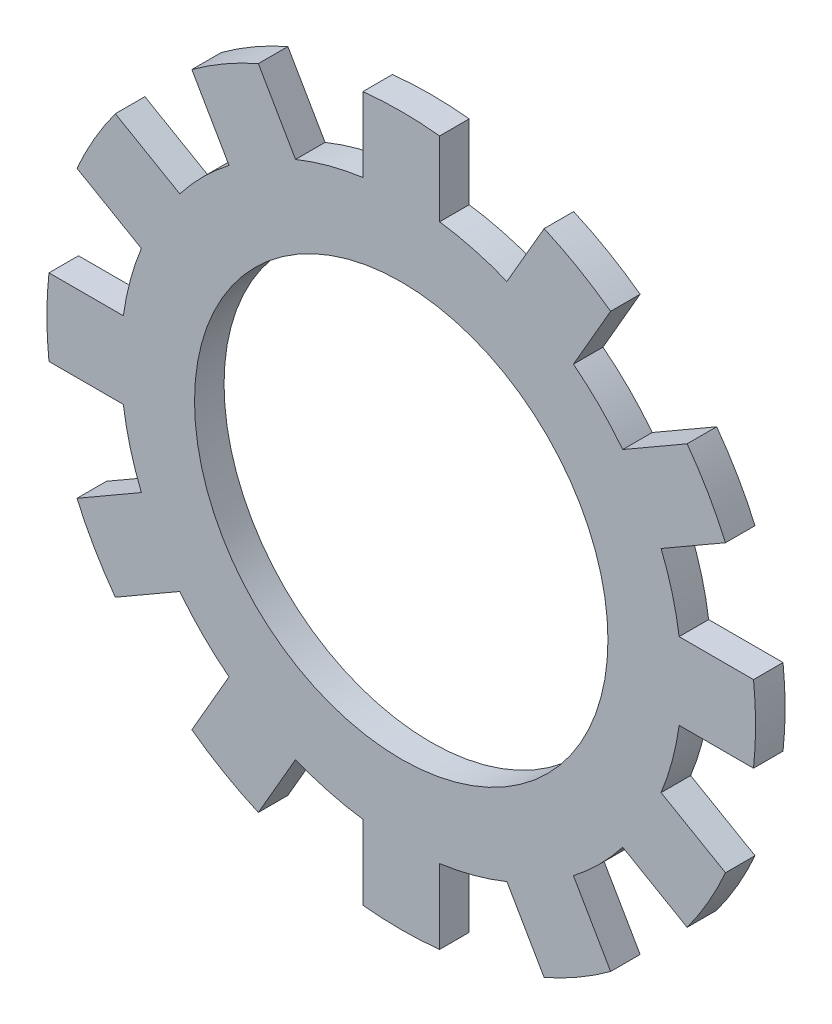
ISO-10303-21;
HEADER;
FILE_DESCRIPTION(('STEP AP214'),'2;1');
FILE_NAME('part.step','',(''),(''),'','','');
FILE_SCHEMA(('AUTOMOTIVE_DESIGN { 1 0 10303 214 1 1 1 1 }'));
ENDSEC;
DATA;
#1=APPLICATION_CONTEXT('core data for automotive mechanical design processes');
#2=APPLICATION_PROTOCOL_DEFINITION('international standard','automotive_design',2000,#1);
#3=PRODUCT_CONTEXT('',#1,'mechanical');
#4=PRODUCT('Part','Part','',(#3));
#5=PRODUCT_RELATED_PRODUCT_CATEGORY('part','',(#4));
#6=PRODUCT_DEFINITION_FORMATION('','',#4);
#7=PRODUCT_DEFINITION_CONTEXT('part definition',#1,'design');
#8=PRODUCT_DEFINITION('design','',#6,#7);
#9=PRODUCT_DEFINITION_SHAPE('','',#8);
#10=(LENGTH_UNIT() NAMED_UNIT(*) SI_UNIT(.MILLI.,.METRE.));
#11=(NAMED_UNIT(*) PLANE_ANGLE_UNIT() SI_UNIT($,.RADIAN.));
#12=(NAMED_UNIT(*) SI_UNIT($,.STERADIAN.) SOLID_ANGLE_UNIT());
#13=UNCERTAINTY_MEASURE_WITH_UNIT(LENGTH_MEASURE(1.E-05),#10,'distance_accuracy_value','');
#14=(GEOMETRIC_REPRESENTATION_CONTEXT(3) GLOBAL_UNCERTAINTY_ASSIGNED_CONTEXT((#13)) GLOBAL_UNIT_ASSIGNED_CONTEXT((#10,
#11,#12)) REPRESENTATION_CONTEXT('',''));
#15=CARTESIAN_POINT('',(0.,0.,0.));
#16=DIRECTION('',(0.,0.,1.));
#17=DIRECTION('',(1.,0.,0.));
#18=AXIS2_PLACEMENT_3D('',#15,#16,#17);
#19=CARTESIAN_POINT('',(0.,0.,0.5));
#20=DIRECTION('',(0.,0.,-1.));
#21=DIRECTION('',(-1.,0.,0.));
#22=AXIS2_PLACEMENT_3D('',#19,#20,#21);
#23=CYLINDRICAL_SURFACE('',#22,9.5);
#24=CARTESIAN_POINT('',(0.,0.,-0.5));
#25=DIRECTION('',(0.,0.,1.));
#26=DIRECTION('',(1.,0.,0.));
#27=AXIS2_PLACEMENT_3D('',#24,#25,#26);
#28=CIRCLE('',#27,9.5);
#29=CARTESIAN_POINT('',(7.49984662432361,5.83114916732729,-0.5));
#30=VERTEX_POINT('',#29);
#31=CARTESIAN_POINT('',(5.83114916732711,7.49984662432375,-0.5));
#32=VERTEX_POINT('',#31);
#33=EDGE_CURVE('E361',#30,#32,#28,.T.);
#34=ORIENTED_EDGE('',*,*,#33,.T.);
#35=DIRECTION('',(0.,0.,-1.));
#36=VECTOR('',#35,1.);
#37=CARTESIAN_POINT('',(5.83114916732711,7.49984662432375,0.5));
#38=LINE('',#37,#36);
#39=CARTESIAN_POINT('',(5.83114916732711,7.49984662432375,0.5));
#40=VERTEX_POINT('',#39);
#41=EDGE_CURVE('E352',#40,#32,#38,.T.);
#42=ORIENTED_EDGE('',*,*,#41,.F.);
#43=CARTESIAN_POINT('',(0.,0.,0.5));
#44=DIRECTION('',(0.,0.,1.));
#45=DIRECTION('',(1.,0.,0.));
#46=AXIS2_PLACEMENT_3D('',#43,#44,#45);
#47=CIRCLE('',#46,9.5);
#48=CARTESIAN_POINT('',(7.49984662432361,5.8311491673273,0.5));
#49=VERTEX_POINT('',#48);
#50=EDGE_CURVE('E64',#49,#40,#47,.T.);
#51=ORIENTED_EDGE('',*,*,#50,.F.);
#52=DIRECTION('',(0.,0.,-1.));
#53=VECTOR('',#52,1.);
#54=CARTESIAN_POINT('',(7.49984662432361,5.83114916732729,0.5));
#55=LINE('',#54,#53);
#56=EDGE_CURVE('E626',#49,#30,#55,.T.);
#57=ORIENTED_EDGE('',*,*,#56,.T.);
#58=EDGE_LOOP('',(#34,#42,#51,#57));
#59=FACE_BOUND('',#58,.T.);
#60=ADVANCED_FACE('F39',(#59),#23,.T.);
#61=DIRECTION('',(0.,0.,-1.));
#62=VECTOR('',#61,1.);
#63=CARTESIAN_POINT('',(3.57948311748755,8.79984662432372,0.5));
#64=LINE('',#63,#62);
#65=CARTESIAN_POINT('',(3.57948311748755,8.79984662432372,0.5));
#66=VERTEX_POINT('',#65);
#67=CARTESIAN_POINT('',(3.57948311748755,8.79984662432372,-0.5));
#68=VERTEX_POINT('',#67);
#69=EDGE_CURVE('E645',#66,#68,#64,.T.);
#70=ORIENTED_EDGE('',*,*,#69,.T.);
#71=CARTESIAN_POINT('',(1.3,9.41063228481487,-0.5));
#72=VERTEX_POINT('',#71);
#73=EDGE_CURVE('E388',#68,#72,#28,.T.);
#74=ORIENTED_EDGE('',*,*,#73,.T.);
#75=DIRECTION('',(0.,0.,-1.));
#76=VECTOR('',#75,1.);
#77=CARTESIAN_POINT('',(1.3,9.41063228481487,0.5));
#78=LINE('',#77,#76);
#79=CARTESIAN_POINT('',(1.3,9.41063228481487,0.5));
#80=VERTEX_POINT('',#79);
#81=EDGE_CURVE('E405',#80,#72,#78,.T.);
#82=ORIENTED_EDGE('',*,*,#81,.F.);
#83=EDGE_CURVE('E50',#66,#80,#47,.T.);
#84=ORIENTED_EDGE('',*,*,#83,.F.);
#85=EDGE_LOOP('',(#70,#74,#82,#84));
#86=FACE_BOUND('',#85,.T.);
#87=ADVANCED_FACE('F817',(#86),#23,.T.);
#88=CARTESIAN_POINT('',(9.41063228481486,1.3000000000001,-0.5));
#89=VERTEX_POINT('',#88);
#90=CARTESIAN_POINT('',(8.79984662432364,3.57948311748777,-0.5));
#91=VERTEX_POINT('',#90);
#92=EDGE_CURVE('E906',#89,#91,#28,.T.);
#93=ORIENTED_EDGE('',*,*,#92,.T.);
#94=DIRECTION('',(0.,0.,-1.));
#95=VECTOR('',#94,1.);
#96=CARTESIAN_POINT('',(8.79984662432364,3.57948311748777,0.5));
#97=LINE('',#96,#95);
#98=CARTESIAN_POINT('',(8.79984662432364,3.57948311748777,0.5));
#99=VERTEX_POINT('',#98);
#100=EDGE_CURVE('E785',#99,#91,#97,.T.);
#101=ORIENTED_EDGE('',*,*,#100,.F.);
#102=CARTESIAN_POINT('',(9.41063228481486,1.3000000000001,0.5));
#103=VERTEX_POINT('',#102);
#104=EDGE_CURVE('E371',#103,#99,#47,.T.);
#105=ORIENTED_EDGE('',*,*,#104,.F.);
#106=DIRECTION('',(0.,0.,-1.));
#107=VECTOR('',#106,1.);
#108=CARTESIAN_POINT('',(9.41063228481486,1.3000000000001,0.5));
#109=LINE('',#108,#107);
#110=EDGE_CURVE('E604',#103,#89,#109,.T.);
#111=ORIENTED_EDGE('',*,*,#110,.T.);
#112=EDGE_LOOP('',(#93,#101,#105,#111));
#113=FACE_BOUND('',#112,.T.);
#114=ADVANCED_FACE('F904',(#113),#23,.T.);
#115=CARTESIAN_POINT('',(8.79984662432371,-3.57948311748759,-0.5));
#116=VERTEX_POINT('',#115);
#117=CARTESIAN_POINT('',(9.41063228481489,-1.2999999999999,-0.5));
#118=VERTEX_POINT('',#117);
#119=EDGE_CURVE('E887',#116,#118,#28,.T.);
#120=ORIENTED_EDGE('',*,*,#119,.T.);
#121=DIRECTION('',(0.,0.,-1.));
#122=VECTOR('',#121,1.);
#123=CARTESIAN_POINT('',(9.41063228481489,-1.2999999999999,0.5));
#124=LINE('',#123,#122);
#125=CARTESIAN_POINT('',(9.41063228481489,-1.2999999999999,0.5));
#126=VERTEX_POINT('',#125);
#127=EDGE_CURVE('E771',#126,#118,#124,.T.);
#128=ORIENTED_EDGE('',*,*,#127,.F.);
#129=CARTESIAN_POINT('',(8.79984662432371,-3.57948311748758,0.5));
#130=VERTEX_POINT('',#129);
#131=EDGE_CURVE('E376',#130,#126,#47,.T.);
#132=ORIENTED_EDGE('',*,*,#131,.F.);
#133=DIRECTION('',(0.,0.,-1.));
#134=VECTOR('',#133,1.);
#135=CARTESIAN_POINT('',(8.79984662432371,-3.57948311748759,0.5));
#136=LINE('',#135,#134);
#137=EDGE_CURVE('E582',#130,#116,#136,.T.);
#138=ORIENTED_EDGE('',*,*,#137,.T.);
#139=EDGE_LOOP('',(#120,#128,#132,#138));
#140=FACE_BOUND('',#139,.T.);
#141=ADVANCED_FACE('F886',(#140),#23,.T.);
#142=CARTESIAN_POINT('',(5.83114916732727,-7.49984662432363,-0.5));
#143=VERTEX_POINT('',#142);
#144=CARTESIAN_POINT('',(7.49984662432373,-5.83114916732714,-0.5));
#145=VERTEX_POINT('',#144);
#146=EDGE_CURVE('E966',#143,#145,#28,.T.);
#147=ORIENTED_EDGE('',*,*,#146,.T.);
#148=DIRECTION('',(0.,0.,-1.));
#149=VECTOR('',#148,1.);
#150=CARTESIAN_POINT('',(7.49984662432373,-5.83114916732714,0.5));
#151=LINE('',#150,#149);
#152=CARTESIAN_POINT('',(7.49984662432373,-5.83114916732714,0.5));
#153=VERTEX_POINT('',#152);
#154=EDGE_CURVE('E757',#153,#145,#151,.T.);
#155=ORIENTED_EDGE('',*,*,#154,.F.);
#156=CARTESIAN_POINT('',(5.83114916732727,-7.49984662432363,0.5));
#157=VERTEX_POINT('',#156);
#158=EDGE_CURVE('E873',#157,#153,#47,.T.);
#159=ORIENTED_EDGE('',*,*,#158,.F.);
#160=DIRECTION('',(0.,0.,-1.));
#161=VECTOR('',#160,1.);
#162=CARTESIAN_POINT('',(5.83114916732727,-7.49984662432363,0.5));
#163=LINE('',#162,#161);
#164=EDGE_CURVE('E560',#157,#143,#163,.T.);
#165=ORIENTED_EDGE('',*,*,#164,.T.);
#166=EDGE_LOOP('',(#147,#155,#159,#165));
#167=FACE_BOUND('',#166,.T.);
#168=ADVANCED_FACE('F974',(#167),#23,.T.);
#169=CARTESIAN_POINT('',(1.3,-9.41063228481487,-0.5));
#170=VERTEX_POINT('',#169);
#171=CARTESIAN_POINT('',(3.57948311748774,-8.79984662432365,-0.5));
#172=VERTEX_POINT('',#171);
#173=EDGE_CURVE('E961',#170,#172,#28,.T.);
#174=ORIENTED_EDGE('',*,*,#173,.T.);
#175=DIRECTION('',(0.,0.,-1.));
#176=VECTOR('',#175,1.);
#177=CARTESIAN_POINT('',(3.57948311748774,-8.79984662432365,0.5));
#178=LINE('',#177,#176);
#179=CARTESIAN_POINT('',(3.57948311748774,-8.79984662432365,0.5));
#180=VERTEX_POINT('',#179);
#181=EDGE_CURVE('E743',#180,#172,#178,.T.);
#182=ORIENTED_EDGE('',*,*,#181,.F.);
#183=CARTESIAN_POINT('',(1.3,-9.41063228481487,0.5));
#184=VERTEX_POINT('',#183);
#185=EDGE_CURVE('E870',#184,#180,#47,.T.);
#186=ORIENTED_EDGE('',*,*,#185,.F.);
#187=DIRECTION('',(0.,0.,-1.));
#188=VECTOR('',#187,1.);
#189=CARTESIAN_POINT('',(1.3,-9.41063228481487,0.5));
#190=LINE('',#189,#188);
#191=EDGE_CURVE('E539',#184,#170,#190,.T.);
#192=ORIENTED_EDGE('',*,*,#191,.T.);
#193=EDGE_LOOP('',(#174,#182,#186,#192));
#194=FACE_BOUND('',#193,.T.);
#195=ADVANCED_FACE('F1402',(#194),#23,.T.);
#196=CARTESIAN_POINT('',(-3.57948311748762,-8.7998466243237,-0.5));
#197=VERTEX_POINT('',#196);
#198=CARTESIAN_POINT('',(-1.3,-9.41063228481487,-0.5));
#199=VERTEX_POINT('',#198);
#200=EDGE_CURVE('E956',#197,#199,#28,.T.);
#201=ORIENTED_EDGE('',*,*,#200,.T.);
#202=DIRECTION('',(0.,0.,-1.));
#203=VECTOR('',#202,1.);
#204=CARTESIAN_POINT('',(-1.3,-9.41063228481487,0.5));
#205=LINE('',#204,#203);
#206=CARTESIAN_POINT('',(-1.3,-9.41063228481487,0.5));
#207=VERTEX_POINT('',#206);
#208=EDGE_CURVE('E729',#207,#199,#205,.T.);
#209=ORIENTED_EDGE('',*,*,#208,.F.);
#210=CARTESIAN_POINT('',(-3.57948311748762,-8.7998466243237,0.5));
#211=VERTEX_POINT('',#210);
#212=EDGE_CURVE('E865',#211,#207,#47,.T.);
#213=ORIENTED_EDGE('',*,*,#212,.F.);
#214=DIRECTION('',(0.,0.,-1.));
#215=VECTOR('',#214,1.);
#216=CARTESIAN_POINT('',(-3.57948311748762,-8.7998466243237,0.5));
#217=LINE('',#216,#215);
#218=EDGE_CURVE('E517',#211,#197,#217,.T.);
#219=ORIENTED_EDGE('',*,*,#218,.T.);
#220=EDGE_LOOP('',(#201,#209,#213,#219));
#221=FACE_BOUND('',#220,.T.);
#222=ADVANCED_FACE('F1394',(#221),#23,.T.);
#223=CARTESIAN_POINT('',(-7.49984662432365,-5.83114916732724,-0.5));
#224=VERTEX_POINT('',#223);
#225=CARTESIAN_POINT('',(-5.83114916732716,-7.49984662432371,-0.5));
#226=VERTEX_POINT('',#225);
#227=EDGE_CURVE('E952',#224,#226,#28,.T.);
#228=ORIENTED_EDGE('',*,*,#227,.T.);
#229=DIRECTION('',(0.,0.,-1.));
#230=VECTOR('',#229,1.);
#231=CARTESIAN_POINT('',(-5.83114916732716,-7.49984662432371,0.5));
#232=LINE('',#231,#230);
#233=CARTESIAN_POINT('',(-5.83114916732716,-7.49984662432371,0.5));
#234=VERTEX_POINT('',#233);
#235=EDGE_CURVE('E715',#234,#226,#232,.T.);
#236=ORIENTED_EDGE('',*,*,#235,.F.);
#237=CARTESIAN_POINT('',(-7.49984662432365,-5.83114916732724,0.5));
#238=VERTEX_POINT('',#237);
#239=EDGE_CURVE('E860',#238,#234,#47,.T.);
#240=ORIENTED_EDGE('',*,*,#239,.F.);
#241=DIRECTION('',(0.,0.,-1.));
#242=VECTOR('',#241,1.);
#243=CARTESIAN_POINT('',(-7.49984662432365,-5.83114916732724,0.5));
#244=LINE('',#243,#242);
#245=EDGE_CURVE('E495',#238,#224,#244,.T.);
#246=ORIENTED_EDGE('',*,*,#245,.T.);
#247=EDGE_LOOP('',(#228,#236,#240,#246));
#248=FACE_BOUND('',#247,.T.);
#249=ADVANCED_FACE('F1386',(#248),#23,.T.);
#250=CARTESIAN_POINT('',(-9.41063228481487,-1.30000000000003,-0.5));
#251=VERTEX_POINT('',#250);
#252=CARTESIAN_POINT('',(-8.79984662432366,-3.57948311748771,-0.5));
#253=VERTEX_POINT('',#252);
#254=EDGE_CURVE('E947',#251,#253,#28,.T.);
#255=ORIENTED_EDGE('',*,*,#254,.T.);
#256=DIRECTION('',(0.,0.,-1.));
#257=VECTOR('',#256,1.);
#258=CARTESIAN_POINT('',(-8.79984662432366,-3.57948311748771,0.5));
#259=LINE('',#258,#257);
#260=CARTESIAN_POINT('',(-8.79984662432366,-3.57948311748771,0.5));
#261=VERTEX_POINT('',#260);
#262=EDGE_CURVE('E701',#261,#253,#259,.T.);
#263=ORIENTED_EDGE('',*,*,#262,.F.);
#264=CARTESIAN_POINT('',(-9.41063228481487,-1.30000000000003,0.5));
#265=VERTEX_POINT('',#264);
#266=EDGE_CURVE('E855',#265,#261,#47,.T.);
#267=ORIENTED_EDGE('',*,*,#266,.F.);
#268=DIRECTION('',(0.,0.,-1.));
#269=VECTOR('',#268,1.);
#270=CARTESIAN_POINT('',(-9.41063228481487,-1.30000000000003,0.5));
#271=LINE('',#270,#269);
#272=EDGE_CURVE('E473',#265,#251,#271,.T.);
#273=ORIENTED_EDGE('',*,*,#272,.T.);
#274=EDGE_LOOP('',(#255,#263,#267,#273));
#275=FACE_BOUND('',#274,.T.);
#276=ADVANCED_FACE('F939',(#275),#23,.T.);
#277=CARTESIAN_POINT('',(-8.79984662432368,3.57948311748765,-0.5));
#278=VERTEX_POINT('',#277);
#279=CARTESIAN_POINT('',(-9.41063228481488,1.29999999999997,-0.5));
#280=VERTEX_POINT('',#279);
#281=EDGE_CURVE('E943',#278,#280,#28,.T.);
#282=ORIENTED_EDGE('',*,*,#281,.T.);
#283=DIRECTION('',(0.,0.,-1.));
#284=VECTOR('',#283,1.);
#285=CARTESIAN_POINT('',(-9.41063228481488,1.29999999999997,0.5));
#286=LINE('',#285,#284);
#287=CARTESIAN_POINT('',(-9.41063228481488,1.29999999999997,0.5));
#288=VERTEX_POINT('',#287);
#289=EDGE_CURVE('E687',#288,#280,#286,.T.);
#290=ORIENTED_EDGE('',*,*,#289,.F.);
#291=CARTESIAN_POINT('',(-8.79984662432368,3.57948311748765,0.5));
#292=VERTEX_POINT('',#291);
#293=EDGE_CURVE('E852',#292,#288,#47,.T.);
#294=ORIENTED_EDGE('',*,*,#293,.F.);
#295=DIRECTION('',(0.,0.,-1.));
#296=VECTOR('',#295,1.);
#297=CARTESIAN_POINT('',(-8.79984662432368,3.57948311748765,0.5));
#298=LINE('',#297,#296);
#299=EDGE_CURVE('E452',#292,#278,#298,.T.);
#300=ORIENTED_EDGE('',*,*,#299,.T.);
#301=EDGE_LOOP('',(#282,#290,#294,#300));
#302=FACE_BOUND('',#301,.T.);
#303=ADVANCED_FACE('F935',(#302),#23,.T.);
#304=CARTESIAN_POINT('',(-5.83114916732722,7.49984662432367,-0.5));
#305=VERTEX_POINT('',#304);
#306=CARTESIAN_POINT('',(-7.49984662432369,5.83114916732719,-0.5));
#307=VERTEX_POINT('',#306);
#308=EDGE_CURVE('E942',#305,#307,#28,.T.);
#309=ORIENTED_EDGE('',*,*,#308,.T.);
#310=DIRECTION('',(0.,0.,-1.));
#311=VECTOR('',#310,1.);
#312=CARTESIAN_POINT('',(-7.49984662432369,5.83114916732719,0.5));
#313=LINE('',#312,#311);
#314=CARTESIAN_POINT('',(-7.49984662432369,5.83114916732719,0.5));
#315=VERTEX_POINT('',#314);
#316=EDGE_CURVE('E673',#315,#307,#313,.T.);
#317=ORIENTED_EDGE('',*,*,#316,.F.);
#318=CARTESIAN_POINT('',(-5.83114916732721,7.49984662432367,0.5));
#319=VERTEX_POINT('',#318);
#320=EDGE_CURVE('E49',#319,#315,#47,.T.);
#321=ORIENTED_EDGE('',*,*,#320,.F.);
#322=DIRECTION('',(0.,0.,-1.));
#323=VECTOR('',#322,1.);
#324=CARTESIAN_POINT('',(-5.83114916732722,7.49984662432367,0.5));
#325=LINE('',#324,#323);
#326=EDGE_CURVE('E430',#319,#305,#325,.T.);
#327=ORIENTED_EDGE('',*,*,#326,.T.);
#328=EDGE_LOOP('',(#309,#317,#321,#327));
#329=FACE_BOUND('',#328,.T.);
#330=ADVANCED_FACE('F929',(#329),#23,.T.);
#331=CARTESIAN_POINT('',(-1.3,9.41063228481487,-0.5));
#332=VERTEX_POINT('',#331);
#333=CARTESIAN_POINT('',(-3.57948311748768,8.79984662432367,-0.5));
#334=VERTEX_POINT('',#333);
#335=EDGE_CURVE('E43',#332,#334,#28,.T.);
#336=ORIENTED_EDGE('',*,*,#335,.T.);
#337=DIRECTION('',(0.,0.,-1.));
#338=VECTOR('',#337,1.);
#339=CARTESIAN_POINT('',(-3.57948311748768,8.79984662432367,0.5));
#340=LINE('',#339,#338);
#341=CARTESIAN_POINT('',(-3.57948311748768,8.79984662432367,0.5));
#342=VERTEX_POINT('',#341);
#343=EDGE_CURVE('E657',#342,#334,#340,.T.);
#344=ORIENTED_EDGE('',*,*,#343,.F.);
#345=CARTESIAN_POINT('',(-1.3,9.41063228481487,0.5));
#346=VERTEX_POINT('',#345);
#347=EDGE_CURVE('E11',#346,#342,#47,.T.);
#348=ORIENTED_EDGE('',*,*,#347,.F.);
#349=DIRECTION('',(0.,0.,-1.));
#350=VECTOR('',#349,1.);
#351=CARTESIAN_POINT('',(-1.3,9.41063228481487,0.5));
#352=LINE('',#351,#350);
#353=EDGE_CURVE('E392',#346,#332,#352,.T.);
#354=ORIENTED_EDGE('',*,*,#353,.T.);
#355=EDGE_LOOP('',(#336,#344,#348,#354));
#356=FACE_BOUND('',#355,.T.);
#357=ADVANCED_FACE('F41',(#356),#23,.T.);
#358=CARTESIAN_POINT('',(0.,0.,0.5));
#359=DIRECTION('',(0.,0.,1.));
#360=DIRECTION('',(1.,0.,0.));
#361=AXIS2_PLACEMENT_3D('',#358,#359,#360);
#362=PLANE('',#361);
#363=ORIENTED_EDGE('',*,*,#347,.T.);
#364=DIRECTION('',(0.500000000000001,-0.866025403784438,0.));
#365=VECTOR('',#364,1.);
#366=CARTESIAN_POINT('',(-4.83885472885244,10.9811422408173,0.5));
#367=LINE('',#366,#365);
#368=CARTESIAN_POINT('',(-4.83885472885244,10.9811422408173,0.5));
#369=VERTEX_POINT('',#368);
#370=EDGE_CURVE('E668',#369,#342,#367,.T.);
#371=ORIENTED_EDGE('',*,*,#370,.F.);
#372=CARTESIAN_POINT('',(0.,0.,0.5));
#373=DIRECTION('',(0.,0.,1.));
#374=DIRECTION('',(0.866025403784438,0.500000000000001,0.));
#375=AXIS2_PLACEMENT_3D('',#372,#373,#374);
#376=CIRCLE('',#375,12.);
#377=CARTESIAN_POINT('',(-7.09052077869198,9.68114224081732,0.5));
#378=VERTEX_POINT('',#377);
#379=EDGE_CURVE('E439',#369,#378,#376,.T.);
#380=ORIENTED_EDGE('',*,*,#379,.T.);
#381=DIRECTION('',(0.500000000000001,-0.866025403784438,0.));
#382=VECTOR('',#381,1.);
#383=CARTESIAN_POINT('',(-7.09052077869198,9.68114224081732,0.5));
#384=LINE('',#383,#382);
#385=EDGE_CURVE('E434',#378,#319,#384,.T.);
#386=ORIENTED_EDGE('',*,*,#385,.T.);
#387=ORIENTED_EDGE('',*,*,#320,.T.);
#388=DIRECTION('',(0.86602540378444,-0.499999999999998,0.));
#389=VECTOR('',#388,1.);
#390=CARTESIAN_POINT('',(-9.68114224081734,7.09052077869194,0.5));
#391=LINE('',#390,#389);
#392=CARTESIAN_POINT('',(-9.68114224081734,7.09052077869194,0.5));
#393=VERTEX_POINT('',#392);
#394=EDGE_CURVE('E682',#393,#315,#391,.T.);
#395=ORIENTED_EDGE('',*,*,#394,.F.);
#396=CARTESIAN_POINT('',(0.,0.,0.5));
#397=DIRECTION('',(0.,0.,1.));
#398=DIRECTION('',(0.499999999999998,0.86602540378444,0.));
#399=AXIS2_PLACEMENT_3D('',#396,#397,#398);
#400=CIRCLE('',#399,12.);
#401=CARTESIAN_POINT('',(-10.9811422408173,4.8388547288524,0.5));
#402=VERTEX_POINT('',#401);
#403=EDGE_CURVE('E460',#393,#402,#400,.T.);
#404=ORIENTED_EDGE('',*,*,#403,.T.);
#405=DIRECTION('',(0.86602540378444,-0.499999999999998,0.));
#406=VECTOR('',#405,1.);
#407=CARTESIAN_POINT('',(-10.9811422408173,4.8388547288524,0.5));
#408=LINE('',#407,#406);
#409=EDGE_CURVE('E456',#402,#292,#408,.T.);
#410=ORIENTED_EDGE('',*,*,#409,.T.);
#411=ORIENTED_EDGE('',*,*,#293,.T.);
#412=DIRECTION('',(1.,0.,0.));
#413=VECTOR('',#412,1.);
#414=CARTESIAN_POINT('',(-11.9293755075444,1.29999999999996,0.5));
#415=LINE('',#414,#413);
#416=CARTESIAN_POINT('',(-11.9293755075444,1.29999999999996,0.5));
#417=VERTEX_POINT('',#416);
#418=EDGE_CURVE('E696',#417,#288,#415,.T.);
#419=ORIENTED_EDGE('',*,*,#418,.F.);
#420=CARTESIAN_POINT('',(0.,0.,0.5));
#421=DIRECTION('',(0.,0.,1.));
#422=DIRECTION('',(0.,1.,0.));
#423=AXIS2_PLACEMENT_3D('',#420,#421,#422);
#424=CIRCLE('',#423,12.);
#425=CARTESIAN_POINT('',(-11.9293755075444,-1.30000000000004,0.5));
#426=VERTEX_POINT('',#425);
#427=EDGE_CURVE('E482',#417,#426,#424,.T.);
#428=ORIENTED_EDGE('',*,*,#427,.T.);
#429=DIRECTION('',(1.,0.,0.));
#430=VECTOR('',#429,1.);
#431=CARTESIAN_POINT('',(-11.9293755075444,-1.30000000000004,0.5));
#432=LINE('',#431,#430);
#433=EDGE_CURVE('E477',#426,#265,#432,.T.);
#434=ORIENTED_EDGE('',*,*,#433,.T.);
#435=ORIENTED_EDGE('',*,*,#266,.T.);
#436=DIRECTION('',(0.866025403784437,0.500000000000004,0.));
#437=VECTOR('',#436,1.);
#438=CARTESIAN_POINT('',(-10.9811422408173,-4.83885472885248,0.5));
#439=LINE('',#438,#437);
#440=CARTESIAN_POINT('',(-10.9811422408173,-4.83885472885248,0.5));
#441=VERTEX_POINT('',#440);
#442=EDGE_CURVE('E710',#441,#261,#439,.T.);
#443=ORIENTED_EDGE('',*,*,#442,.F.);
#444=CARTESIAN_POINT('',(0.,0.,0.5));
#445=DIRECTION('',(0.,0.,1.));
#446=DIRECTION('',(-0.500000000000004,0.866025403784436,0.));
#447=AXIS2_PLACEMENT_3D('',#444,#445,#446);
#448=CIRCLE('',#447,12.);
#449=CARTESIAN_POINT('',(-9.68114224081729,-7.09052077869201,0.5));
#450=VERTEX_POINT('',#449);
#451=EDGE_CURVE('E504',#441,#450,#448,.T.);
#452=ORIENTED_EDGE('',*,*,#451,.T.);
#453=DIRECTION('',(0.866025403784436,0.500000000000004,0.));
#454=VECTOR('',#453,1.);
#455=CARTESIAN_POINT('',(-9.68114224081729,-7.09052077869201,0.5));
#456=LINE('',#455,#454);
#457=EDGE_CURVE('E499',#450,#238,#456,.T.);
#458=ORIENTED_EDGE('',*,*,#457,.T.);
#459=ORIENTED_EDGE('',*,*,#239,.T.);
#460=DIRECTION('',(0.499999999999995,0.866025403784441,0.));
#461=VECTOR('',#460,1.);
#462=CARTESIAN_POINT('',(-7.09052077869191,-9.68114224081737,0.5));
#463=LINE('',#462,#461);
#464=CARTESIAN_POINT('',(-7.09052077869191,-9.68114224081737,0.5));
#465=VERTEX_POINT('',#464);
#466=EDGE_CURVE('E724',#465,#234,#463,.T.);
#467=ORIENTED_EDGE('',*,*,#466,.F.);
#468=CARTESIAN_POINT('',(0.,0.,0.5));
#469=DIRECTION('',(0.,0.,1.));
#470=DIRECTION('',(-0.866025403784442,0.499999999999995,0.));
#471=AXIS2_PLACEMENT_3D('',#468,#469,#470);
#472=CIRCLE('',#471,12.);
#473=CARTESIAN_POINT('',(-4.83885472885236,-10.9811422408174,0.5));
#474=VERTEX_POINT('',#473);
#475=EDGE_CURVE('E526',#465,#474,#472,.T.);
#476=ORIENTED_EDGE('',*,*,#475,.T.);
#477=DIRECTION('',(0.499999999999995,0.866025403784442,0.));
#478=VECTOR('',#477,1.);
#479=CARTESIAN_POINT('',(-4.83885472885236,-10.9811422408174,0.5));
#480=LINE('',#479,#478);
#481=EDGE_CURVE('E521',#474,#211,#480,.T.);
#482=ORIENTED_EDGE('',*,*,#481,.T.);
#483=ORIENTED_EDGE('',*,*,#212,.T.);
#484=DIRECTION('',(0.,1.,0.));
#485=VECTOR('',#484,1.);
#486=CARTESIAN_POINT('',(-1.3,-11.9293755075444,0.5));
#487=LINE('',#486,#485);
#488=CARTESIAN_POINT('',(-1.3,-11.9293755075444,0.5));
#489=VERTEX_POINT('',#488);
#490=EDGE_CURVE('E738',#489,#207,#487,.T.);
#491=ORIENTED_EDGE('',*,*,#490,.F.);
#492=CARTESIAN_POINT('',(0.,0.,0.5));
#493=DIRECTION('',(0.,0.,1.));
#494=DIRECTION('',(-1.,0.,0.));
#495=AXIS2_PLACEMENT_3D('',#492,#493,#494);
#496=CIRCLE('',#495,12.);
#497=CARTESIAN_POINT('',(1.3,-11.9293755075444,0.5));
#498=VERTEX_POINT('',#497);
#499=EDGE_CURVE('E547',#489,#498,#496,.T.);
#500=ORIENTED_EDGE('',*,*,#499,.T.);
#501=DIRECTION('',(0.,1.,0.));
#502=VECTOR('',#501,1.);
#503=CARTESIAN_POINT('',(1.3,-11.9293755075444,0.5));
#504=LINE('',#503,#502);
#505=EDGE_CURVE('E542',#498,#184,#504,.T.);
#506=ORIENTED_EDGE('',*,*,#505,.T.);
#507=ORIENTED_EDGE('',*,*,#185,.T.);
#508=DIRECTION('',(-0.500000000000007,0.866025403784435,0.));
#509=VECTOR('',#508,1.);
#510=CARTESIAN_POINT('',(4.83885472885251,-10.9811422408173,0.5));
#511=LINE('',#510,#509);
#512=CARTESIAN_POINT('',(4.83885472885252,-10.9811422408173,0.5));
#513=VERTEX_POINT('',#512);
#514=EDGE_CURVE('E752',#513,#180,#511,.T.);
#515=ORIENTED_EDGE('',*,*,#514,.F.);
#516=CARTESIAN_POINT('',(0.,0.,0.5));
#517=DIRECTION('',(0.,0.,1.));
#518=DIRECTION('',(-0.866025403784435,-0.500000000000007,0.));
#519=AXIS2_PLACEMENT_3D('',#516,#517,#518);
#520=CIRCLE('',#519,12.);
#521=CARTESIAN_POINT('',(7.09052077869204,-9.68114224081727,0.5));
#522=VERTEX_POINT('',#521);
#523=EDGE_CURVE('E569',#513,#522,#520,.T.);
#524=ORIENTED_EDGE('',*,*,#523,.T.);
#525=DIRECTION('',(-0.500000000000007,0.866025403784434,0.));
#526=VECTOR('',#525,1.);
#527=CARTESIAN_POINT('',(7.09052077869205,-9.68114224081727,0.5));
#528=LINE('',#527,#526);
#529=EDGE_CURVE('E564',#522,#157,#528,.T.);
#530=ORIENTED_EDGE('',*,*,#529,.T.);
#531=ORIENTED_EDGE('',*,*,#158,.T.);
#532=DIRECTION('',(-0.866025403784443,0.499999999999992,0.));
#533=VECTOR('',#532,1.);
#534=CARTESIAN_POINT('',(9.68114224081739,-7.09052077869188,0.5));
#535=LINE('',#534,#533);
#536=CARTESIAN_POINT('',(9.68114224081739,-7.09052077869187,0.5));
#537=VERTEX_POINT('',#536);
#538=EDGE_CURVE('E766',#537,#153,#535,.T.);
#539=ORIENTED_EDGE('',*,*,#538,.F.);
#540=CARTESIAN_POINT('',(0.,0.,0.5));
#541=DIRECTION('',(0.,0.,1.));
#542=DIRECTION('',(-0.499999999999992,-0.866025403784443,0.));
#543=AXIS2_PLACEMENT_3D('',#540,#541,#542);
#544=CIRCLE('',#543,12.);
#545=CARTESIAN_POINT('',(10.9811422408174,-4.83885472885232,0.5));
#546=VERTEX_POINT('',#545);
#547=EDGE_CURVE('E591',#537,#546,#544,.T.);
#548=ORIENTED_EDGE('',*,*,#547,.T.);
#549=DIRECTION('',(-0.866025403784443,0.499999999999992,0.));
#550=VECTOR('',#549,1.);
#551=CARTESIAN_POINT('',(10.9811422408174,-4.83885472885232,0.5));
#552=LINE('',#551,#550);
#553=EDGE_CURVE('E586',#546,#130,#552,.T.);
#554=ORIENTED_EDGE('',*,*,#553,.T.);
#555=ORIENTED_EDGE('',*,*,#131,.T.);
#556=DIRECTION('',(-1.,0.,0.));
#557=VECTOR('',#556,1.);
#558=CARTESIAN_POINT('',(11.9293755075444,-1.29999999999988,0.5));
#559=LINE('',#558,#557);
#560=CARTESIAN_POINT('',(11.9293755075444,-1.29999999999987,0.5));
#561=VERTEX_POINT('',#560);
#562=EDGE_CURVE('E780',#561,#126,#559,.T.);
#563=ORIENTED_EDGE('',*,*,#562,.F.);
#564=CARTESIAN_POINT('',(0.,0.,0.5));
#565=DIRECTION('',(0.,0.,1.));
#566=DIRECTION('',(0.,-1.,0.));
#567=AXIS2_PLACEMENT_3D('',#564,#565,#566);
#568=CIRCLE('',#567,12.);
#569=CARTESIAN_POINT('',(11.9293755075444,1.30000000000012,0.5));
#570=VERTEX_POINT('',#569);
#571=EDGE_CURVE('E613',#561,#570,#568,.T.);
#572=ORIENTED_EDGE('',*,*,#571,.T.);
#573=DIRECTION('',(-1.,0.,0.));
#574=VECTOR('',#573,1.);
#575=CARTESIAN_POINT('',(11.9293755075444,1.30000000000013,0.5));
#576=LINE('',#575,#574);
#577=EDGE_CURVE('E608',#570,#103,#576,.T.);
#578=ORIENTED_EDGE('',*,*,#577,.T.);
#579=ORIENTED_EDGE('',*,*,#104,.T.);
#580=DIRECTION('',(-0.866025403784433,-0.50000000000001,0.));
#581=VECTOR('',#580,1.);
#582=CARTESIAN_POINT('',(10.9811422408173,4.83885472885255,0.5));
#583=LINE('',#582,#581);
#584=CARTESIAN_POINT('',(10.9811422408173,4.83885472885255,0.5));
#585=VERTEX_POINT('',#584);
#586=EDGE_CURVE('E794',#585,#99,#583,.T.);
#587=ORIENTED_EDGE('',*,*,#586,.F.);
#588=CARTESIAN_POINT('',(0.,0.,0.5));
#589=DIRECTION('',(0.,0.,1.));
#590=DIRECTION('',(0.50000000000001,-0.866025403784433,0.));
#591=AXIS2_PLACEMENT_3D('',#588,#589,#590);
#592=CIRCLE('',#591,12.);
#593=CARTESIAN_POINT('',(9.68114224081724,7.09052077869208,0.5));
#594=VERTEX_POINT('',#593);
#595=EDGE_CURVE('E633',#585,#594,#592,.T.);
#596=ORIENTED_EDGE('',*,*,#595,.T.);
#597=DIRECTION('',(-0.866025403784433,-0.50000000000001,0.));
#598=VECTOR('',#597,1.);
#599=CARTESIAN_POINT('',(9.68114224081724,7.09052077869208,0.5));
#600=LINE('',#599,#598);
#601=EDGE_CURVE('E368',#594,#49,#600,.T.);
#602=ORIENTED_EDGE('',*,*,#601,.T.);
#603=ORIENTED_EDGE('',*,*,#50,.T.);
#604=DIRECTION('',(-0.499999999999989,-0.866025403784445,0.));
#605=VECTOR('',#604,1.);
#606=CARTESIAN_POINT('',(7.09052077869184,9.68114224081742,0.5));
#607=LINE('',#606,#605);
#608=CARTESIAN_POINT('',(7.09052077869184,9.68114224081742,0.5));
#609=VERTEX_POINT('',#608);
#610=EDGE_CURVE('E349',#609,#40,#607,.T.);
#611=ORIENTED_EDGE('',*,*,#610,.F.);
#612=CARTESIAN_POINT('',(0.,0.,0.5));
#613=DIRECTION('',(0.,0.,1.));
#614=DIRECTION('',(0.866025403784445,-0.499999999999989,0.));
#615=AXIS2_PLACEMENT_3D('',#612,#613,#614);
#616=CIRCLE('',#615,12.);
#617=CARTESIAN_POINT('',(4.83885472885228,10.9811422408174,0.5));
#618=VERTEX_POINT('',#617);
#619=EDGE_CURVE('E653',#609,#618,#616,.T.);
#620=ORIENTED_EDGE('',*,*,#619,.T.);
#621=DIRECTION('',(-0.499999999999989,-0.866025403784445,0.));
#622=VECTOR('',#621,1.);
#623=CARTESIAN_POINT('',(4.83885472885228,10.9811422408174,0.5));
#624=LINE('',#623,#622);
#625=EDGE_CURVE('E648',#618,#66,#624,.T.);
#626=ORIENTED_EDGE('',*,*,#625,.T.);
#627=ORIENTED_EDGE('',*,*,#83,.T.);
#628=DIRECTION('',(0.,-1.,0.));
#629=VECTOR('',#628,1.);
#630=CARTESIAN_POINT('',(1.3,11.9293755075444,0.5));
#631=LINE('',#630,#629);
#632=CARTESIAN_POINT('',(1.3,11.9293755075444,0.5));
#633=VERTEX_POINT('',#632);
#634=EDGE_CURVE('E418',#633,#80,#631,.T.);
#635=ORIENTED_EDGE('',*,*,#634,.F.);
#636=CARTESIAN_POINT('',(0.,0.,0.5));
#637=DIRECTION('',(0.,0.,1.));
#638=DIRECTION('',(1.,0.,0.));
#639=AXIS2_PLACEMENT_3D('',#636,#637,#638);
#640=CIRCLE('',#639,12.);
#641=CARTESIAN_POINT('',(-1.3,11.9293755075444,0.5));
#642=VERTEX_POINT('',#641);
#643=EDGE_CURVE('E401',#633,#642,#640,.T.);
#644=ORIENTED_EDGE('',*,*,#643,.T.);
#645=DIRECTION('',(0.,-1.,0.));
#646=VECTOR('',#645,1.);
#647=CARTESIAN_POINT('',(-1.3,11.9293755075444,0.5));
#648=LINE('',#647,#646);
#649=EDGE_CURVE('E396',#642,#346,#648,.T.);
#650=ORIENTED_EDGE('',*,*,#649,.T.);
#651=EDGE_LOOP('',(#363,#371,#380,#386,#387,#395,#404,#410,#411,#419,#428,#434,#435,#443,#452,
#458,#459,#467,#476,#482,#483,#491,#500,#506,#507,#515,#524,#530,#531,#539,#548,#554,#555,#563,
#572,#578,#579,#587,#596,#602,#603,#611,#620,#626,#627,#635,#644,#650));
#652=FACE_BOUND('',#651,.T.);
#653=CARTESIAN_POINT('',(0.,0.,0.5));
#654=DIRECTION('',(0.,0.,1.));
#655=DIRECTION('',(1.,0.,0.));
#656=AXIS2_PLACEMENT_3D('',#653,#654,#655);
#657=CIRCLE('',#656,7.);
#658=CARTESIAN_POINT('',(7.,0.,0.5));
#659=VERTEX_POINT('',#658);
#660=EDGE_CURVE('E383',#659,#659,#657,.T.);
#661=ORIENTED_EDGE('',*,*,#660,.F.);
#662=EDGE_LOOP('',(#661));
#663=FACE_BOUND('',#662,.T.);
#664=ADVANCED_FACE('F365',(#652,#663),#362,.T.);
#665=CARTESIAN_POINT('',(0.,0.,-0.5));
#666=DIRECTION('',(0.,0.,1.));
#667=DIRECTION('',(1.,0.,0.));
#668=AXIS2_PLACEMENT_3D('',#665,#666,#667);
#669=PLANE('',#668);
#670=ORIENTED_EDGE('',*,*,#335,.F.);
#671=DIRECTION('',(0.,-1.,0.));
#672=VECTOR('',#671,1.);
#673=CARTESIAN_POINT('',(-1.3,11.9293755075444,-0.5));
#674=LINE('',#673,#672);
#675=CARTESIAN_POINT('',(-1.3,11.9293755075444,-0.5));
#676=VERTEX_POINT('',#675);
#677=EDGE_CURVE('E397',#676,#332,#674,.T.);
#678=ORIENTED_EDGE('',*,*,#677,.F.);
#679=CARTESIAN_POINT('',(0.,0.,-0.5));
#680=DIRECTION('',(0.,0.,1.));
#681=DIRECTION('',(1.,0.,0.));
#682=AXIS2_PLACEMENT_3D('',#679,#680,#681);
#683=CIRCLE('',#682,12.);
#684=CARTESIAN_POINT('',(1.3,11.9293755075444,-0.5));
#685=VERTEX_POINT('',#684);
#686=EDGE_CURVE('E402',#685,#676,#683,.T.);
#687=ORIENTED_EDGE('',*,*,#686,.F.);
#688=DIRECTION('',(0.,-1.,0.));
#689=VECTOR('',#688,1.);
#690=CARTESIAN_POINT('',(1.3,11.9293755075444,-0.5));
#691=LINE('',#690,#689);
#692=EDGE_CURVE('E419',#685,#72,#691,.T.);
#693=ORIENTED_EDGE('',*,*,#692,.T.);
#694=ORIENTED_EDGE('',*,*,#73,.F.);
#695=DIRECTION('',(-0.499999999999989,-0.866025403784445,0.));
#696=VECTOR('',#695,1.);
#697=CARTESIAN_POINT('',(4.83885472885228,10.9811422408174,-0.5));
#698=LINE('',#697,#696);
#699=CARTESIAN_POINT('',(4.83885472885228,10.9811422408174,-0.5));
#700=VERTEX_POINT('',#699);
#701=EDGE_CURVE('E649',#700,#68,#698,.T.);
#702=ORIENTED_EDGE('',*,*,#701,.F.);
#703=CARTESIAN_POINT('',(0.,0.,-0.5));
#704=DIRECTION('',(0.,0.,1.));
#705=DIRECTION('',(0.866025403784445,-0.499999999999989,0.));
#706=AXIS2_PLACEMENT_3D('',#703,#704,#705);
#707=CIRCLE('',#706,12.);
#708=CARTESIAN_POINT('',(7.09052077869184,9.68114224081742,-0.5));
#709=VERTEX_POINT('',#708);
#710=EDGE_CURVE('E654',#709,#700,#707,.T.);
#711=ORIENTED_EDGE('',*,*,#710,.F.);
#712=DIRECTION('',(-0.499999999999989,-0.866025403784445,0.));
#713=VECTOR('',#712,1.);
#714=CARTESIAN_POINT('',(7.09052077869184,9.68114224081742,-0.5));
#715=LINE('',#714,#713);
#716=EDGE_CURVE('E358',#709,#32,#715,.T.);
#717=ORIENTED_EDGE('',*,*,#716,.T.);
#718=ORIENTED_EDGE('',*,*,#33,.F.);
#719=DIRECTION('',(-0.866025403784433,-0.50000000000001,0.));
#720=VECTOR('',#719,1.);
#721=CARTESIAN_POINT('',(9.68114224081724,7.09052077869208,-0.5));
#722=LINE('',#721,#720);
#723=CARTESIAN_POINT('',(9.68114224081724,7.09052077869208,-0.5));
#724=VERTEX_POINT('',#723);
#725=EDGE_CURVE('E629',#724,#30,#722,.T.);
#726=ORIENTED_EDGE('',*,*,#725,.F.);
#727=CARTESIAN_POINT('',(0.,0.,-0.5));
#728=DIRECTION('',(0.,0.,1.));
#729=DIRECTION('',(0.50000000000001,-0.866025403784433,0.));
#730=AXIS2_PLACEMENT_3D('',#727,#728,#729);
#731=CIRCLE('',#730,12.);
#732=CARTESIAN_POINT('',(10.9811422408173,4.83885472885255,-0.5));
#733=VERTEX_POINT('',#732);
#734=EDGE_CURVE('E634',#733,#724,#731,.T.);
#735=ORIENTED_EDGE('',*,*,#734,.F.);
#736=DIRECTION('',(-0.866025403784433,-0.50000000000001,0.));
#737=VECTOR('',#736,1.);
#738=CARTESIAN_POINT('',(10.9811422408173,4.83885472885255,-0.5));
#739=LINE('',#738,#737);
#740=EDGE_CURVE('E363',#733,#91,#739,.T.);
#741=ORIENTED_EDGE('',*,*,#740,.T.);
#742=ORIENTED_EDGE('',*,*,#92,.F.);
#743=DIRECTION('',(-1.,0.,0.));
#744=VECTOR('',#743,1.);
#745=CARTESIAN_POINT('',(11.9293755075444,1.30000000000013,-0.5));
#746=LINE('',#745,#744);
#747=CARTESIAN_POINT('',(11.9293755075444,1.30000000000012,-0.5));
#748=VERTEX_POINT('',#747);
#749=EDGE_CURVE('E609',#748,#89,#746,.T.);
#750=ORIENTED_EDGE('',*,*,#749,.F.);
#751=CARTESIAN_POINT('',(0.,0.,-0.5));
#752=DIRECTION('',(0.,0.,1.));
#753=DIRECTION('',(0.,-1.,0.));
#754=AXIS2_PLACEMENT_3D('',#751,#752,#753);
#755=CIRCLE('',#754,12.);
#756=CARTESIAN_POINT('',(11.9293755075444,-1.29999999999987,-0.5));
#757=VERTEX_POINT('',#756);
#758=EDGE_CURVE('E614',#757,#748,#755,.T.);
#759=ORIENTED_EDGE('',*,*,#758,.F.);
#760=DIRECTION('',(-1.,0.,0.));
#761=VECTOR('',#760,1.);
#762=CARTESIAN_POINT('',(11.9293755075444,-1.29999999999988,-0.5));
#763=LINE('',#762,#761);
#764=EDGE_CURVE('E781',#757,#118,#763,.T.);
#765=ORIENTED_EDGE('',*,*,#764,.T.);
#766=ORIENTED_EDGE('',*,*,#119,.F.);
#767=DIRECTION('',(-0.866025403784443,0.499999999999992,0.));
#768=VECTOR('',#767,1.);
#769=CARTESIAN_POINT('',(10.9811422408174,-4.83885472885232,-0.5));
#770=LINE('',#769,#768);
#771=CARTESIAN_POINT('',(10.9811422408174,-4.83885472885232,-0.5));
#772=VERTEX_POINT('',#771);
#773=EDGE_CURVE('E587',#772,#116,#770,.T.);
#774=ORIENTED_EDGE('',*,*,#773,.F.);
#775=CARTESIAN_POINT('',(0.,0.,-0.5));
#776=DIRECTION('',(0.,0.,1.));
#777=DIRECTION('',(-0.499999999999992,-0.866025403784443,0.));
#778=AXIS2_PLACEMENT_3D('',#775,#776,#777);
#779=CIRCLE('',#778,12.);
#780=CARTESIAN_POINT('',(9.68114224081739,-7.09052077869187,-0.5));
#781=VERTEX_POINT('',#780);
#782=EDGE_CURVE('E592',#781,#772,#779,.T.);
#783=ORIENTED_EDGE('',*,*,#782,.F.);
#784=DIRECTION('',(-0.866025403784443,0.499999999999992,0.));
#785=VECTOR('',#784,1.);
#786=CARTESIAN_POINT('',(9.68114224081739,-7.09052077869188,-0.5));
#787=LINE('',#786,#785);
#788=EDGE_CURVE('E767',#781,#145,#787,.T.);
#789=ORIENTED_EDGE('',*,*,#788,.T.);
#790=ORIENTED_EDGE('',*,*,#146,.F.);
#791=DIRECTION('',(-0.500000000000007,0.866025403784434,0.));
#792=VECTOR('',#791,1.);
#793=CARTESIAN_POINT('',(7.09052077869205,-9.68114224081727,-0.5));
#794=LINE('',#793,#792);
#795=CARTESIAN_POINT('',(7.09052077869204,-9.68114224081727,-0.5));
#796=VERTEX_POINT('',#795);
#797=EDGE_CURVE('E565',#796,#143,#794,.T.);
#798=ORIENTED_EDGE('',*,*,#797,.F.);
#799=CARTESIAN_POINT('',(0.,0.,-0.5));
#800=DIRECTION('',(0.,0.,1.));
#801=DIRECTION('',(-0.866025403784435,-0.500000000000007,0.));
#802=AXIS2_PLACEMENT_3D('',#799,#800,#801);
#803=CIRCLE('',#802,12.);
#804=CARTESIAN_POINT('',(4.83885472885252,-10.9811422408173,-0.5));
#805=VERTEX_POINT('',#804);
#806=EDGE_CURVE('E570',#805,#796,#803,.T.);
#807=ORIENTED_EDGE('',*,*,#806,.F.);
#808=DIRECTION('',(-0.500000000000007,0.866025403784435,0.));
#809=VECTOR('',#808,1.);
#810=CARTESIAN_POINT('',(4.83885472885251,-10.9811422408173,-0.5));
#811=LINE('',#810,#809);
#812=EDGE_CURVE('E753',#805,#172,#811,.T.);
#813=ORIENTED_EDGE('',*,*,#812,.T.);
#814=ORIENTED_EDGE('',*,*,#173,.F.);
#815=DIRECTION('',(0.,1.,0.));
#816=VECTOR('',#815,1.);
#817=CARTESIAN_POINT('',(1.3,-11.9293755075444,-0.5));
#818=LINE('',#817,#816);
#819=CARTESIAN_POINT('',(1.3,-11.9293755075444,-0.5));
#820=VERTEX_POINT('',#819);
#821=EDGE_CURVE('E543',#820,#170,#818,.T.);
#822=ORIENTED_EDGE('',*,*,#821,.F.);
#823=CARTESIAN_POINT('',(0.,0.,-0.5));
#824=DIRECTION('',(0.,0.,1.));
#825=DIRECTION('',(-1.,0.,0.));
#826=AXIS2_PLACEMENT_3D('',#823,#824,#825);
#827=CIRCLE('',#826,12.);
#828=CARTESIAN_POINT('',(-1.3,-11.9293755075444,-0.5));
#829=VERTEX_POINT('',#828);
#830=EDGE_CURVE('E548',#829,#820,#827,.T.);
#831=ORIENTED_EDGE('',*,*,#830,.F.);
#832=DIRECTION('',(0.,1.,0.));
#833=VECTOR('',#832,1.);
#834=CARTESIAN_POINT('',(-1.3,-11.9293755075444,-0.5));
#835=LINE('',#834,#833);
#836=EDGE_CURVE('E739',#829,#199,#835,.T.);
#837=ORIENTED_EDGE('',*,*,#836,.T.);
#838=ORIENTED_EDGE('',*,*,#200,.F.);
#839=DIRECTION('',(0.499999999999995,0.866025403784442,0.));
#840=VECTOR('',#839,1.);
#841=CARTESIAN_POINT('',(-4.83885472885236,-10.9811422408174,-0.5));
#842=LINE('',#841,#840);
#843=CARTESIAN_POINT('',(-4.83885472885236,-10.9811422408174,-0.5));
#844=VERTEX_POINT('',#843);
#845=EDGE_CURVE('E522',#844,#197,#842,.T.);
#846=ORIENTED_EDGE('',*,*,#845,.F.);
#847=CARTESIAN_POINT('',(0.,0.,-0.5));
#848=DIRECTION('',(0.,0.,1.));
#849=DIRECTION('',(-0.866025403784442,0.499999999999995,0.));
#850=AXIS2_PLACEMENT_3D('',#847,#848,#849);
#851=CIRCLE('',#850,12.);
#852=CARTESIAN_POINT('',(-7.09052077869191,-9.68114224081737,-0.5));
#853=VERTEX_POINT('',#852);
#854=EDGE_CURVE('E527',#853,#844,#851,.T.);
#855=ORIENTED_EDGE('',*,*,#854,.F.);
#856=DIRECTION('',(0.499999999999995,0.866025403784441,0.));
#857=VECTOR('',#856,1.);
#858=CARTESIAN_POINT('',(-7.09052077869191,-9.68114224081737,-0.5));
#859=LINE('',#858,#857);
#860=EDGE_CURVE('E725',#853,#226,#859,.T.);
#861=ORIENTED_EDGE('',*,*,#860,.T.);
#862=ORIENTED_EDGE('',*,*,#227,.F.);
#863=DIRECTION('',(0.866025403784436,0.500000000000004,0.));
#864=VECTOR('',#863,1.);
#865=CARTESIAN_POINT('',(-9.68114224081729,-7.09052077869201,-0.5));
#866=LINE('',#865,#864);
#867=CARTESIAN_POINT('',(-9.68114224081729,-7.09052077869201,-0.5));
#868=VERTEX_POINT('',#867);
#869=EDGE_CURVE('E500',#868,#224,#866,.T.);
#870=ORIENTED_EDGE('',*,*,#869,.F.);
#871=CARTESIAN_POINT('',(0.,0.,-0.5));
#872=DIRECTION('',(0.,0.,1.));
#873=DIRECTION('',(-0.500000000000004,0.866025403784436,0.));
#874=AXIS2_PLACEMENT_3D('',#871,#872,#873);
#875=CIRCLE('',#874,12.);
#876=CARTESIAN_POINT('',(-10.9811422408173,-4.83885472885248,-0.5));
#877=VERTEX_POINT('',#876);
#878=EDGE_CURVE('E505',#877,#868,#875,.T.);
#879=ORIENTED_EDGE('',*,*,#878,.F.);
#880=DIRECTION('',(0.866025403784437,0.500000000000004,0.));
#881=VECTOR('',#880,1.);
#882=CARTESIAN_POINT('',(-10.9811422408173,-4.83885472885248,-0.5));
#883=LINE('',#882,#881);
#884=EDGE_CURVE('E711',#877,#253,#883,.T.);
#885=ORIENTED_EDGE('',*,*,#884,.T.);
#886=ORIENTED_EDGE('',*,*,#254,.F.);
#887=DIRECTION('',(1.,0.,0.));
#888=VECTOR('',#887,1.);
#889=CARTESIAN_POINT('',(-11.9293755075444,-1.30000000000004,-0.5));
#890=LINE('',#889,#888);
#891=CARTESIAN_POINT('',(-11.9293755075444,-1.30000000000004,-0.5));
#892=VERTEX_POINT('',#891);
#893=EDGE_CURVE('E478',#892,#251,#890,.T.);
#894=ORIENTED_EDGE('',*,*,#893,.F.);
#895=CARTESIAN_POINT('',(0.,0.,-0.5));
#896=DIRECTION('',(0.,0.,1.));
#897=DIRECTION('',(0.,1.,0.));
#898=AXIS2_PLACEMENT_3D('',#895,#896,#897);
#899=CIRCLE('',#898,12.);
#900=CARTESIAN_POINT('',(-11.9293755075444,1.29999999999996,-0.5));
#901=VERTEX_POINT('',#900);
#902=EDGE_CURVE('E483',#901,#892,#899,.T.);
#903=ORIENTED_EDGE('',*,*,#902,.F.);
#904=DIRECTION('',(1.,0.,0.));
#905=VECTOR('',#904,1.);
#906=CARTESIAN_POINT('',(-11.9293755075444,1.29999999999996,-0.5));
#907=LINE('',#906,#905);
#908=EDGE_CURVE('E697',#901,#280,#907,.T.);
#909=ORIENTED_EDGE('',*,*,#908,.T.);
#910=ORIENTED_EDGE('',*,*,#281,.F.);
#911=DIRECTION('',(0.86602540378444,-0.499999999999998,0.));
#912=VECTOR('',#911,1.);
#913=CARTESIAN_POINT('',(-10.9811422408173,4.8388547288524,-0.5));
#914=LINE('',#913,#912);
#915=CARTESIAN_POINT('',(-10.9811422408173,4.8388547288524,-0.5));
#916=VERTEX_POINT('',#915);
#917=EDGE_CURVE('E457',#916,#278,#914,.T.);
#918=ORIENTED_EDGE('',*,*,#917,.F.);
#919=CARTESIAN_POINT('',(0.,0.,-0.5));
#920=DIRECTION('',(0.,0.,1.));
#921=DIRECTION('',(0.499999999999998,0.86602540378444,0.));
#922=AXIS2_PLACEMENT_3D('',#919,#920,#921);
#923=CIRCLE('',#922,12.);
#924=CARTESIAN_POINT('',(-9.68114224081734,7.09052077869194,-0.5));
#925=VERTEX_POINT('',#924);
#926=EDGE_CURVE('E461',#925,#916,#923,.T.);
#927=ORIENTED_EDGE('',*,*,#926,.F.);
#928=DIRECTION('',(0.86602540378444,-0.499999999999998,0.));
#929=VECTOR('',#928,1.);
#930=CARTESIAN_POINT('',(-9.68114224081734,7.09052077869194,-0.5));
#931=LINE('',#930,#929);
#932=EDGE_CURVE('E683',#925,#307,#931,.T.);
#933=ORIENTED_EDGE('',*,*,#932,.T.);
#934=ORIENTED_EDGE('',*,*,#308,.F.);
#935=DIRECTION('',(0.500000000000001,-0.866025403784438,0.));
#936=VECTOR('',#935,1.);
#937=CARTESIAN_POINT('',(-7.09052077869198,9.68114224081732,-0.5));
#938=LINE('',#937,#936);
#939=CARTESIAN_POINT('',(-7.09052077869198,9.68114224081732,-0.5));
#940=VERTEX_POINT('',#939);
#941=EDGE_CURVE('E435',#940,#305,#938,.T.);
#942=ORIENTED_EDGE('',*,*,#941,.F.);
#943=CARTESIAN_POINT('',(0.,0.,-0.5));
#944=DIRECTION('',(0.,0.,1.));
#945=DIRECTION('',(0.866025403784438,0.500000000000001,0.));
#946=AXIS2_PLACEMENT_3D('',#943,#944,#945);
#947=CIRCLE('',#946,12.);
#948=CARTESIAN_POINT('',(-4.83885472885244,10.9811422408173,-0.5));
#949=VERTEX_POINT('',#948);
#950=EDGE_CURVE('E440',#949,#940,#947,.T.);
#951=ORIENTED_EDGE('',*,*,#950,.F.);
#952=DIRECTION('',(0.500000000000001,-0.866025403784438,0.));
#953=VECTOR('',#952,1.);
#954=CARTESIAN_POINT('',(-4.83885472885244,10.9811422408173,-0.5));
#955=LINE('',#954,#953);
#956=EDGE_CURVE('E669',#949,#334,#955,.T.);
#957=ORIENTED_EDGE('',*,*,#956,.T.);
#958=EDGE_LOOP('',(#670,#678,#687,#693,#694,#702,#711,#717,#718,#726,#735,#741,#742,#750,#759,
#765,#766,#774,#783,#789,#790,#798,#807,#813,#814,#822,#831,#837,#838,#846,#855,#861,#862,#870,
#879,#885,#886,#894,#903,#909,#910,#918,#927,#933,#934,#942,#951,#957));
#959=FACE_BOUND('',#958,.T.);
#960=CARTESIAN_POINT('',(0.,0.,-0.5));
#961=DIRECTION('',(0.,0.,1.));
#962=DIRECTION('',(1.,0.,0.));
#963=AXIS2_PLACEMENT_3D('',#960,#961,#962);
#964=CIRCLE('',#963,7.);
#965=CARTESIAN_POINT('',(7.,0.,-0.5));
#966=VERTEX_POINT('',#965);
#967=EDGE_CURVE('E379',#966,#966,#964,.T.);
#968=ORIENTED_EDGE('',*,*,#967,.T.);
#969=EDGE_LOOP('',(#968));
#970=FACE_BOUND('',#969,.T.);
#971=ADVANCED_FACE('F805',(#959,#970),#669,.F.);
#972=CARTESIAN_POINT('',(0.,0.,0.5));
#973=DIRECTION('',(0.,0.,-1.));
#974=DIRECTION('',(-1.,0.,0.));
#975=AXIS2_PLACEMENT_3D('',#972,#973,#974);
#976=CYLINDRICAL_SURFACE('',#975,7.);
#977=ORIENTED_EDGE('',*,*,#660,.T.);
#978=EDGE_LOOP('',(#977));
#979=FACE_BOUND('',#978,.T.);
#980=ORIENTED_EDGE('',*,*,#967,.F.);
#981=EDGE_LOOP('',(#980));
#982=FACE_BOUND('',#981,.T.);
#983=ADVANCED_FACE('F1054',(#979,#982),#976,.F.);
#984=CARTESIAN_POINT('',(0.,0.,0.5));
#985=DIRECTION('',(0.,0.,-1.));
#986=DIRECTION('',(-1.,0.,0.));
#987=AXIS2_PLACEMENT_3D('',#984,#985,#986);
#988=CYLINDRICAL_SURFACE('',#987,12.);
#989=ORIENTED_EDGE('',*,*,#686,.T.);
#990=DIRECTION('',(0.,0.,-1.));
#991=VECTOR('',#990,1.);
#992=CARTESIAN_POINT('',(-1.3,11.9293755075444,0.5));
#993=LINE('',#992,#991);
#994=EDGE_CURVE('E384',#642,#676,#993,.T.);
#995=ORIENTED_EDGE('',*,*,#994,.F.);
#996=ORIENTED_EDGE('',*,*,#643,.F.);
#997=DIRECTION('',(0.,0.,-1.));
#998=VECTOR('',#997,1.);
#999=CARTESIAN_POINT('',(1.3,11.9293755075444,0.5));
#1000=LINE('',#999,#998);
#1001=EDGE_CURVE('E414',#633,#685,#1000,.T.);
#1002=ORIENTED_EDGE('',*,*,#1001,.T.);
#1003=EDGE_LOOP('',(#989,#995,#996,#1002));
#1004=FACE_BOUND('',#1003,.T.);
#1005=ADVANCED_FACE('F826',(#1004),#988,.T.);
#1006=CARTESIAN_POINT('',(-1.3,11.9293755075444,0.5));
#1007=DIRECTION('',(1.,0.,0.));
#1008=DIRECTION('',(0.,1.,0.));
#1009=AXIS2_PLACEMENT_3D('',#1006,#1007,#1008);
#1010=PLANE('',#1009);
#1011=ORIENTED_EDGE('',*,*,#677,.T.);
#1012=ORIENTED_EDGE('',*,*,#353,.F.);
#1013=ORIENTED_EDGE('',*,*,#649,.F.);
#1014=ORIENTED_EDGE('',*,*,#994,.T.);
#1015=EDGE_LOOP('',(#1011,#1012,#1013,#1014));
#1016=FACE_BOUND('',#1015,.T.);
#1017=ADVANCED_FACE('F830',(#1016),#1010,.F.);
#1018=CARTESIAN_POINT('',(1.3,11.9293755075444,0.5));
#1019=DIRECTION('',(1.,0.,0.));
#1020=DIRECTION('',(0.,1.,0.));
#1021=AXIS2_PLACEMENT_3D('',#1018,#1019,#1020);
#1022=PLANE('',#1021);
#1023=ORIENTED_EDGE('',*,*,#692,.F.);
#1024=ORIENTED_EDGE('',*,*,#1001,.F.);
#1025=ORIENTED_EDGE('',*,*,#634,.T.);
#1026=ORIENTED_EDGE('',*,*,#81,.T.);
#1027=EDGE_LOOP('',(#1023,#1024,#1025,#1026));
#1028=FACE_BOUND('',#1027,.T.);
#1029=ADVANCED_FACE('F821',(#1028),#1022,.T.);
#1030=CARTESIAN_POINT('',(0.,0.,0.5));
#1031=DIRECTION('',(0.,0.,-1.));
#1032=DIRECTION('',(-1.,0.,0.));
#1033=AXIS2_PLACEMENT_3D('',#1030,#1031,#1032);
#1034=CYLINDRICAL_SURFACE('',#1033,12.);
#1035=ORIENTED_EDGE('',*,*,#950,.T.);
#1036=DIRECTION('',(0.,0.,-1.));
#1037=VECTOR('',#1036,1.);
#1038=CARTESIAN_POINT('',(-7.09052077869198,9.68114224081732,0.5));
#1039=LINE('',#1038,#1037);
#1040=EDGE_CURVE('E423',#378,#940,#1039,.T.);
#1041=ORIENTED_EDGE('',*,*,#1040,.F.);
#1042=ORIENTED_EDGE('',*,*,#379,.F.);
#1043=DIRECTION('',(0.,0.,-1.));
#1044=VECTOR('',#1043,1.);
#1045=CARTESIAN_POINT('',(-4.83885472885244,10.9811422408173,0.5));
#1046=LINE('',#1045,#1044);
#1047=EDGE_CURVE('E664',#369,#949,#1046,.T.);
#1048=ORIENTED_EDGE('',*,*,#1047,.T.);
#1049=EDGE_LOOP('',(#1035,#1041,#1042,#1048));
#1050=FACE_BOUND('',#1049,.T.);
#1051=ADVANCED_FACE('F841',(#1050),#1034,.T.);
#1052=CARTESIAN_POINT('',(-7.09052077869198,9.68114224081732,0.5));
#1053=DIRECTION('',(0.866025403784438,0.500000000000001,0.));
#1054=DIRECTION('',(-0.500000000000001,0.866025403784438,0.));
#1055=AXIS2_PLACEMENT_3D('',#1052,#1053,#1054);
#1056=PLANE('',#1055);
#1057=ORIENTED_EDGE('',*,*,#941,.T.);
#1058=ORIENTED_EDGE('',*,*,#326,.F.);
#1059=ORIENTED_EDGE('',*,*,#385,.F.);
#1060=ORIENTED_EDGE('',*,*,#1040,.T.);
#1061=EDGE_LOOP('',(#1057,#1058,#1059,#1060));
#1062=FACE_BOUND('',#1061,.T.);
#1063=ADVANCED_FACE('F846',(#1062),#1056,.F.);
#1064=CARTESIAN_POINT('',(0.,0.,0.5));
#1065=DIRECTION('',(0.,0.,-1.));
#1066=DIRECTION('',(-1.,0.,0.));
#1067=AXIS2_PLACEMENT_3D('',#1064,#1065,#1066);
#1068=CYLINDRICAL_SURFACE('',#1067,12.);
#1069=ORIENTED_EDGE('',*,*,#926,.T.);
#1070=DIRECTION('',(0.,0.,-1.));
#1071=VECTOR('',#1070,1.);
#1072=CARTESIAN_POINT('',(-10.9811422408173,4.8388547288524,0.5));
#1073=LINE('',#1072,#1071);
#1074=EDGE_CURVE('E443',#402,#916,#1073,.T.);
#1075=ORIENTED_EDGE('',*,*,#1074,.F.);
#1076=ORIENTED_EDGE('',*,*,#403,.F.);
#1077=DIRECTION('',(0.,0.,-1.));
#1078=VECTOR('',#1077,1.);
#1079=CARTESIAN_POINT('',(-9.68114224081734,7.09052077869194,0.5));
#1080=LINE('',#1079,#1078);
#1081=EDGE_CURVE('E678',#393,#925,#1080,.T.);
#1082=ORIENTED_EDGE('',*,*,#1081,.T.);
#1083=EDGE_LOOP('',(#1069,#1075,#1076,#1082));
#1084=FACE_BOUND('',#1083,.T.);
#1085=ADVANCED_FACE('F1039',(#1084),#1068,.T.);
#1086=CARTESIAN_POINT('',(-10.9811422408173,4.8388547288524,0.5));
#1087=DIRECTION('',(0.499999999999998,0.86602540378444,0.));
#1088=DIRECTION('',(-0.86602540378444,0.499999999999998,0.));
#1089=AXIS2_PLACEMENT_3D('',#1086,#1087,#1088);
#1090=PLANE('',#1089);
#1091=ORIENTED_EDGE('',*,*,#917,.T.);
#1092=ORIENTED_EDGE('',*,*,#299,.F.);
#1093=ORIENTED_EDGE('',*,*,#409,.F.);
#1094=ORIENTED_EDGE('',*,*,#1074,.T.);
#1095=EDGE_LOOP('',(#1091,#1092,#1093,#1094));
#1096=FACE_BOUND('',#1095,.T.);
#1097=ADVANCED_FACE('F1035',(#1096),#1090,.F.);
#1098=CARTESIAN_POINT('',(0.,0.,0.5));
#1099=DIRECTION('',(0.,0.,-1.));
#1100=DIRECTION('',(-1.,0.,0.));
#1101=AXIS2_PLACEMENT_3D('',#1098,#1099,#1100);
#1102=CYLINDRICAL_SURFACE('',#1101,12.);
#1103=ORIENTED_EDGE('',*,*,#902,.T.);
#1104=DIRECTION('',(0.,0.,-1.));
#1105=VECTOR('',#1104,1.);
#1106=CARTESIAN_POINT('',(-11.9293755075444,-1.30000000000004,0.5));
#1107=LINE('',#1106,#1105);
#1108=EDGE_CURVE('E464',#426,#892,#1107,.T.);
#1109=ORIENTED_EDGE('',*,*,#1108,.F.);
#1110=ORIENTED_EDGE('',*,*,#427,.F.);
#1111=DIRECTION('',(0.,0.,-1.));
#1112=VECTOR('',#1111,1.);
#1113=CARTESIAN_POINT('',(-11.9293755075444,1.29999999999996,0.5));
#1114=LINE('',#1113,#1112);
#1115=EDGE_CURVE('E692',#417,#901,#1114,.T.);
#1116=ORIENTED_EDGE('',*,*,#1115,.T.);
#1117=EDGE_LOOP('',(#1103,#1109,#1110,#1116));
#1118=FACE_BOUND('',#1117,.T.);
#1119=ADVANCED_FACE('F1031',(#1118),#1102,.T.);
#1120=CARTESIAN_POINT('',(-11.9293755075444,-1.30000000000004,0.5));
#1121=DIRECTION('',(0.,1.,0.));
#1122=DIRECTION('',(-1.,0.,0.));
#1123=AXIS2_PLACEMENT_3D('',#1120,#1121,#1122);
#1124=PLANE('',#1123);
#1125=ORIENTED_EDGE('',*,*,#893,.T.);
#1126=ORIENTED_EDGE('',*,*,#272,.F.);
#1127=ORIENTED_EDGE('',*,*,#433,.F.);
#1128=ORIENTED_EDGE('',*,*,#1108,.T.);
#1129=EDGE_LOOP('',(#1125,#1126,#1127,#1128));
#1130=FACE_BOUND('',#1129,.T.);
#1131=ADVANCED_FACE('F1027',(#1130),#1124,.F.);
#1132=CARTESIAN_POINT('',(0.,0.,0.5));
#1133=DIRECTION('',(0.,0.,-1.));
#1134=DIRECTION('',(-1.,0.,0.));
#1135=AXIS2_PLACEMENT_3D('',#1132,#1133,#1134);
#1136=CYLINDRICAL_SURFACE('',#1135,12.);
#1137=ORIENTED_EDGE('',*,*,#878,.T.);
#1138=DIRECTION('',(0.,0.,-1.));
#1139=VECTOR('',#1138,1.);
#1140=CARTESIAN_POINT('',(-9.68114224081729,-7.09052077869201,0.5));
#1141=LINE('',#1140,#1139);
#1142=EDGE_CURVE('E486',#450,#868,#1141,.T.);
#1143=ORIENTED_EDGE('',*,*,#1142,.F.);
#1144=ORIENTED_EDGE('',*,*,#451,.F.);
#1145=DIRECTION('',(0.,0.,-1.));
#1146=VECTOR('',#1145,1.);
#1147=CARTESIAN_POINT('',(-10.9811422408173,-4.83885472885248,0.5));
#1148=LINE('',#1147,#1146);
#1149=EDGE_CURVE('E706',#441,#877,#1148,.T.);
#1150=ORIENTED_EDGE('',*,*,#1149,.T.);
#1151=EDGE_LOOP('',(#1137,#1143,#1144,#1150));
#1152=FACE_BOUND('',#1151,.T.);
#1153=ADVANCED_FACE('F1023',(#1152),#1136,.T.);
#1154=CARTESIAN_POINT('',(-9.68114224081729,-7.09052077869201,0.5));
#1155=DIRECTION('',(-0.500000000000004,0.866025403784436,0.));
#1156=DIRECTION('',(-0.866025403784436,-0.500000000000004,0.));
#1157=AXIS2_PLACEMENT_3D('',#1154,#1155,#1156);
#1158=PLANE('',#1157);
#1159=ORIENTED_EDGE('',*,*,#869,.T.);
#1160=ORIENTED_EDGE('',*,*,#245,.F.);
#1161=ORIENTED_EDGE('',*,*,#457,.F.);
#1162=ORIENTED_EDGE('',*,*,#1142,.T.);
#1163=EDGE_LOOP('',(#1159,#1160,#1161,#1162));
#1164=FACE_BOUND('',#1163,.T.);
#1165=ADVANCED_FACE('F1019',(#1164),#1158,.F.);
#1166=CARTESIAN_POINT('',(0.,0.,0.5));
#1167=DIRECTION('',(0.,0.,-1.));
#1168=DIRECTION('',(-1.,0.,0.));
#1169=AXIS2_PLACEMENT_3D('',#1166,#1167,#1168);
#1170=CYLINDRICAL_SURFACE('',#1169,12.);
#1171=ORIENTED_EDGE('',*,*,#854,.T.);
#1172=DIRECTION('',(0.,0.,-1.));
#1173=VECTOR('',#1172,1.);
#1174=CARTESIAN_POINT('',(-4.83885472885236,-10.9811422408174,0.5));
#1175=LINE('',#1174,#1173);
#1176=EDGE_CURVE('E508',#474,#844,#1175,.T.);
#1177=ORIENTED_EDGE('',*,*,#1176,.F.);
#1178=ORIENTED_EDGE('',*,*,#475,.F.);
#1179=DIRECTION('',(0.,0.,-1.));
#1180=VECTOR('',#1179,1.);
#1181=CARTESIAN_POINT('',(-7.09052077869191,-9.68114224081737,0.5));
#1182=LINE('',#1181,#1180);
#1183=EDGE_CURVE('E720',#465,#853,#1182,.T.);
#1184=ORIENTED_EDGE('',*,*,#1183,.T.);
#1185=EDGE_LOOP('',(#1171,#1177,#1178,#1184));
#1186=FACE_BOUND('',#1185,.T.);
#1187=ADVANCED_FACE('F1015',(#1186),#1170,.T.);
#1188=CARTESIAN_POINT('',(-4.83885472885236,-10.9811422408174,0.5));
#1189=DIRECTION('',(-0.866025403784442,0.499999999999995,0.));
#1190=DIRECTION('',(-0.499999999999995,-0.866025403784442,0.));
#1191=AXIS2_PLACEMENT_3D('',#1188,#1189,#1190);
#1192=PLANE('',#1191);
#1193=ORIENTED_EDGE('',*,*,#845,.T.);
#1194=ORIENTED_EDGE('',*,*,#218,.F.);
#1195=ORIENTED_EDGE('',*,*,#481,.F.);
#1196=ORIENTED_EDGE('',*,*,#1176,.T.);
#1197=EDGE_LOOP('',(#1193,#1194,#1195,#1196));
#1198=FACE_BOUND('',#1197,.T.);
#1199=ADVANCED_FACE('F1011',(#1198),#1192,.F.);
#1200=CARTESIAN_POINT('',(0.,0.,0.5));
#1201=DIRECTION('',(0.,0.,-1.));
#1202=DIRECTION('',(-1.,0.,0.));
#1203=AXIS2_PLACEMENT_3D('',#1200,#1201,#1202);
#1204=CYLINDRICAL_SURFACE('',#1203,12.);
#1205=ORIENTED_EDGE('',*,*,#830,.T.);
#1206=DIRECTION('',(0.,0.,-1.));
#1207=VECTOR('',#1206,1.);
#1208=CARTESIAN_POINT('',(1.3,-11.9293755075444,0.5));
#1209=LINE('',#1208,#1207);
#1210=EDGE_CURVE('E530',#498,#820,#1209,.T.);
#1211=ORIENTED_EDGE('',*,*,#1210,.F.);
#1212=ORIENTED_EDGE('',*,*,#499,.F.);
#1213=DIRECTION('',(0.,0.,-1.));
#1214=VECTOR('',#1213,1.);
#1215=CARTESIAN_POINT('',(-1.3,-11.9293755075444,0.5));
#1216=LINE('',#1215,#1214);
#1217=EDGE_CURVE('E734',#489,#829,#1216,.T.);
#1218=ORIENTED_EDGE('',*,*,#1217,.T.);
#1219=EDGE_LOOP('',(#1205,#1211,#1212,#1218));
#1220=FACE_BOUND('',#1219,.T.);
#1221=ADVANCED_FACE('F1007',(#1220),#1204,.T.);
#1222=CARTESIAN_POINT('',(1.3,-11.9293755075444,0.5));
#1223=DIRECTION('',(-1.,0.,0.));
#1224=DIRECTION('',(0.,-1.,0.));
#1225=AXIS2_PLACEMENT_3D('',#1222,#1223,#1224);
#1226=PLANE('',#1225);
#1227=ORIENTED_EDGE('',*,*,#821,.T.);
#1228=ORIENTED_EDGE('',*,*,#191,.F.);
#1229=ORIENTED_EDGE('',*,*,#505,.F.);
#1230=ORIENTED_EDGE('',*,*,#1210,.T.);
#1231=EDGE_LOOP('',(#1227,#1228,#1229,#1230));
#1232=FACE_BOUND('',#1231,.T.);
#1233=ADVANCED_FACE('F1003',(#1232),#1226,.F.);
#1234=CARTESIAN_POINT('',(0.,0.,0.5));
#1235=DIRECTION('',(0.,0.,-1.));
#1236=DIRECTION('',(-1.,0.,0.));
#1237=AXIS2_PLACEMENT_3D('',#1234,#1235,#1236);
#1238=CYLINDRICAL_SURFACE('',#1237,12.);
#1239=ORIENTED_EDGE('',*,*,#806,.T.);
#1240=DIRECTION('',(0.,0.,-1.));
#1241=VECTOR('',#1240,1.);
#1242=CARTESIAN_POINT('',(7.09052077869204,-9.68114224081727,0.5));
#1243=LINE('',#1242,#1241);
#1244=EDGE_CURVE('E551',#522,#796,#1243,.T.);
#1245=ORIENTED_EDGE('',*,*,#1244,.F.);
#1246=ORIENTED_EDGE('',*,*,#523,.F.);
#1247=DIRECTION('',(0.,0.,-1.));
#1248=VECTOR('',#1247,1.);
#1249=CARTESIAN_POINT('',(4.83885472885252,-10.9811422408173,0.5));
#1250=LINE('',#1249,#1248);
#1251=EDGE_CURVE('E748',#513,#805,#1250,.T.);
#1252=ORIENTED_EDGE('',*,*,#1251,.T.);
#1253=EDGE_LOOP('',(#1239,#1245,#1246,#1252));
#1254=FACE_BOUND('',#1253,.T.);
#1255=ADVANCED_FACE('F999',(#1254),#1238,.T.);
#1256=CARTESIAN_POINT('',(7.09052077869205,-9.68114224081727,0.5));
#1257=DIRECTION('',(-0.866025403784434,-0.500000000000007,0.));
#1258=DIRECTION('',(0.500000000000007,-0.866025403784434,0.));
#1259=AXIS2_PLACEMENT_3D('',#1256,#1257,#1258);
#1260=PLANE('',#1259);
#1261=ORIENTED_EDGE('',*,*,#797,.T.);
#1262=ORIENTED_EDGE('',*,*,#164,.F.);
#1263=ORIENTED_EDGE('',*,*,#529,.F.);
#1264=ORIENTED_EDGE('',*,*,#1244,.T.);
#1265=EDGE_LOOP('',(#1261,#1262,#1263,#1264));
#1266=FACE_BOUND('',#1265,.T.);
#1267=ADVANCED_FACE('F993',(#1266),#1260,.F.);
#1268=CARTESIAN_POINT('',(0.,0.,0.5));
#1269=DIRECTION('',(0.,0.,-1.));
#1270=DIRECTION('',(-1.,0.,0.));
#1271=AXIS2_PLACEMENT_3D('',#1268,#1269,#1270);
#1272=CYLINDRICAL_SURFACE('',#1271,12.);
#1273=ORIENTED_EDGE('',*,*,#782,.T.);
#1274=DIRECTION('',(0.,0.,-1.));
#1275=VECTOR('',#1274,1.);
#1276=CARTESIAN_POINT('',(10.9811422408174,-4.83885472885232,0.5));
#1277=LINE('',#1276,#1275);
#1278=EDGE_CURVE('E573',#546,#772,#1277,.T.);
#1279=ORIENTED_EDGE('',*,*,#1278,.F.);
#1280=ORIENTED_EDGE('',*,*,#547,.F.);
#1281=DIRECTION('',(0.,0.,-1.));
#1282=VECTOR('',#1281,1.);
#1283=CARTESIAN_POINT('',(9.68114224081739,-7.09052077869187,0.5));
#1284=LINE('',#1283,#1282);
#1285=EDGE_CURVE('E762',#537,#781,#1284,.T.);
#1286=ORIENTED_EDGE('',*,*,#1285,.T.);
#1287=EDGE_LOOP('',(#1273,#1279,#1280,#1286));
#1288=FACE_BOUND('',#1287,.T.);
#1289=ADVANCED_FACE('F983',(#1288),#1272,.T.);
#1290=CARTESIAN_POINT('',(10.9811422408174,-4.83885472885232,0.5));
#1291=DIRECTION('',(-0.499999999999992,-0.866025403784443,0.));
#1292=DIRECTION('',(0.866025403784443,-0.499999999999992,0.));
#1293=AXIS2_PLACEMENT_3D('',#1290,#1291,#1292);
#1294=PLANE('',#1293);
#1295=ORIENTED_EDGE('',*,*,#773,.T.);
#1296=ORIENTED_EDGE('',*,*,#137,.F.);
#1297=ORIENTED_EDGE('',*,*,#553,.F.);
#1298=ORIENTED_EDGE('',*,*,#1278,.T.);
#1299=EDGE_LOOP('',(#1295,#1296,#1297,#1298));
#1300=FACE_BOUND('',#1299,.T.);
#1301=ADVANCED_FACE('F985',(#1300),#1294,.F.);
#1302=CARTESIAN_POINT('',(0.,0.,0.5));
#1303=DIRECTION('',(0.,0.,-1.));
#1304=DIRECTION('',(-1.,0.,0.));
#1305=AXIS2_PLACEMENT_3D('',#1302,#1303,#1304);
#1306=CYLINDRICAL_SURFACE('',#1305,12.);
#1307=ORIENTED_EDGE('',*,*,#758,.T.);
#1308=DIRECTION('',(0.,0.,-1.));
#1309=VECTOR('',#1308,1.);
#1310=CARTESIAN_POINT('',(11.9293755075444,1.30000000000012,0.5));
#1311=LINE('',#1310,#1309);
#1312=EDGE_CURVE('E595',#570,#748,#1311,.T.);
#1313=ORIENTED_EDGE('',*,*,#1312,.F.);
#1314=ORIENTED_EDGE('',*,*,#571,.F.);
#1315=DIRECTION('',(0.,0.,-1.));
#1316=VECTOR('',#1315,1.);
#1317=CARTESIAN_POINT('',(11.9293755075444,-1.29999999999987,0.5));
#1318=LINE('',#1317,#1316);
#1319=EDGE_CURVE('E776',#561,#757,#1318,.T.);
#1320=ORIENTED_EDGE('',*,*,#1319,.T.);
#1321=EDGE_LOOP('',(#1307,#1313,#1314,#1320));
#1322=FACE_BOUND('',#1321,.T.);
#1323=ADVANCED_FACE('F896',(#1322),#1306,.T.);
#1324=CARTESIAN_POINT('',(11.9293755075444,1.30000000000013,0.5));
#1325=DIRECTION('',(0.,-1.,0.));
#1326=DIRECTION('',(1.,0.,0.));
#1327=AXIS2_PLACEMENT_3D('',#1324,#1325,#1326);
#1328=PLANE('',#1327);
#1329=ORIENTED_EDGE('',*,*,#749,.T.);
#1330=ORIENTED_EDGE('',*,*,#110,.F.);
#1331=ORIENTED_EDGE('',*,*,#577,.F.);
#1332=ORIENTED_EDGE('',*,*,#1312,.T.);
#1333=EDGE_LOOP('',(#1329,#1330,#1331,#1332));
#1334=FACE_BOUND('',#1333,.T.);
#1335=ADVANCED_FACE('F901',(#1334),#1328,.F.);
#1336=CARTESIAN_POINT('',(0.,0.,0.5));
#1337=DIRECTION('',(0.,0.,-1.));
#1338=DIRECTION('',(-1.,0.,0.));
#1339=AXIS2_PLACEMENT_3D('',#1336,#1337,#1338);
#1340=CYLINDRICAL_SURFACE('',#1339,12.);
#1341=ORIENTED_EDGE('',*,*,#734,.T.);
#1342=DIRECTION('',(0.,0.,-1.));
#1343=VECTOR('',#1342,1.);
#1344=CARTESIAN_POINT('',(9.68114224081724,7.09052077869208,0.5));
#1345=LINE('',#1344,#1343);
#1346=EDGE_CURVE('E617',#594,#724,#1345,.T.);
#1347=ORIENTED_EDGE('',*,*,#1346,.F.);
#1348=ORIENTED_EDGE('',*,*,#595,.F.);
#1349=DIRECTION('',(0.,0.,-1.));
#1350=VECTOR('',#1349,1.);
#1351=CARTESIAN_POINT('',(10.9811422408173,4.83885472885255,0.5));
#1352=LINE('',#1351,#1350);
#1353=EDGE_CURVE('E790',#585,#733,#1352,.T.);
#1354=ORIENTED_EDGE('',*,*,#1353,.T.);
#1355=EDGE_LOOP('',(#1341,#1347,#1348,#1354));
#1356=FACE_BOUND('',#1355,.T.);
#1357=ADVANCED_FACE('F913',(#1356),#1340,.T.);
#1358=CARTESIAN_POINT('',(9.68114224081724,7.09052077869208,0.5));
#1359=DIRECTION('',(0.50000000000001,-0.866025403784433,0.));
#1360=DIRECTION('',(0.866025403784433,0.50000000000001,0.));
#1361=AXIS2_PLACEMENT_3D('',#1358,#1359,#1360);
#1362=PLANE('',#1361);
#1363=ORIENTED_EDGE('',*,*,#725,.T.);
#1364=ORIENTED_EDGE('',*,*,#56,.F.);
#1365=ORIENTED_EDGE('',*,*,#601,.F.);
#1366=ORIENTED_EDGE('',*,*,#1346,.T.);
#1367=EDGE_LOOP('',(#1363,#1364,#1365,#1366));
#1368=FACE_BOUND('',#1367,.T.);
#1369=ADVANCED_FACE('F915',(#1368),#1362,.F.);
#1370=CARTESIAN_POINT('',(0.,0.,0.5));
#1371=DIRECTION('',(0.,0.,-1.));
#1372=DIRECTION('',(-1.,0.,0.));
#1373=AXIS2_PLACEMENT_3D('',#1370,#1371,#1372);
#1374=CYLINDRICAL_SURFACE('',#1373,12.);
#1375=ORIENTED_EDGE('',*,*,#710,.T.);
#1376=DIRECTION('',(0.,0.,-1.));
#1377=VECTOR('',#1376,1.);
#1378=CARTESIAN_POINT('',(4.83885472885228,10.9811422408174,0.5));
#1379=LINE('',#1378,#1377);
#1380=EDGE_CURVE('E637',#618,#700,#1379,.T.);
#1381=ORIENTED_EDGE('',*,*,#1380,.F.);
#1382=ORIENTED_EDGE('',*,*,#619,.F.);
#1383=DIRECTION('',(0.,0.,-1.));
#1384=VECTOR('',#1383,1.);
#1385=CARTESIAN_POINT('',(7.09052077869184,9.68114224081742,0.5));
#1386=LINE('',#1385,#1384);
#1387=EDGE_CURVE('E355',#609,#709,#1386,.T.);
#1388=ORIENTED_EDGE('',*,*,#1387,.T.);
#1389=EDGE_LOOP('',(#1375,#1381,#1382,#1388));
#1390=FACE_BOUND('',#1389,.T.);
#1391=ADVANCED_FACE('F811',(#1390),#1374,.T.);
#1392=CARTESIAN_POINT('',(4.83885472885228,10.9811422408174,0.5));
#1393=DIRECTION('',(0.866025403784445,-0.499999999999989,0.));
#1394=DIRECTION('',(0.499999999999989,0.866025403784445,0.));
#1395=AXIS2_PLACEMENT_3D('',#1392,#1393,#1394);
#1396=PLANE('',#1395);
#1397=ORIENTED_EDGE('',*,*,#701,.T.);
#1398=ORIENTED_EDGE('',*,*,#69,.F.);
#1399=ORIENTED_EDGE('',*,*,#625,.F.);
#1400=ORIENTED_EDGE('',*,*,#1380,.T.);
#1401=EDGE_LOOP('',(#1397,#1398,#1399,#1400));
#1402=FACE_BOUND('',#1401,.T.);
#1403=ADVANCED_FACE('F816',(#1402),#1396,.F.);
#1404=CARTESIAN_POINT('',(-4.83885472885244,10.9811422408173,0.5));
#1405=DIRECTION('',(0.866025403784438,0.500000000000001,0.));
#1406=DIRECTION('',(-0.500000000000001,0.866025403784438,0.));
#1407=AXIS2_PLACEMENT_3D('',#1404,#1405,#1406);
#1408=PLANE('',#1407);
#1409=ORIENTED_EDGE('',*,*,#956,.F.);
#1410=ORIENTED_EDGE('',*,*,#1047,.F.);
#1411=ORIENTED_EDGE('',*,*,#370,.T.);
#1412=ORIENTED_EDGE('',*,*,#343,.T.);
#1413=EDGE_LOOP('',(#1409,#1410,#1411,#1412));
#1414=FACE_BOUND('',#1413,.T.);
#1415=ADVANCED_FACE('F839',(#1414),#1408,.T.);
#1416=CARTESIAN_POINT('',(-9.68114224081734,7.09052077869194,0.5));
#1417=DIRECTION('',(0.499999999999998,0.86602540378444,0.));
#1418=DIRECTION('',(-0.86602540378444,0.499999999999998,0.));
#1419=AXIS2_PLACEMENT_3D('',#1416,#1417,#1418);
#1420=PLANE('',#1419);
#1421=ORIENTED_EDGE('',*,*,#932,.F.);
#1422=ORIENTED_EDGE('',*,*,#1081,.F.);
#1423=ORIENTED_EDGE('',*,*,#394,.T.);
#1424=ORIENTED_EDGE('',*,*,#316,.T.);
#1425=EDGE_LOOP('',(#1421,#1422,#1423,#1424));
#1426=FACE_BOUND('',#1425,.T.);
#1427=ADVANCED_FACE('F1160',(#1426),#1420,.T.);
#1428=CARTESIAN_POINT('',(-11.9293755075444,1.29999999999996,0.5));
#1429=DIRECTION('',(0.,1.,0.));
#1430=DIRECTION('',(-1.,0.,0.));
#1431=AXIS2_PLACEMENT_3D('',#1428,#1429,#1430);
#1432=PLANE('',#1431);
#1433=ORIENTED_EDGE('',*,*,#908,.F.);
#1434=ORIENTED_EDGE('',*,*,#1115,.F.);
#1435=ORIENTED_EDGE('',*,*,#418,.T.);
#1436=ORIENTED_EDGE('',*,*,#289,.T.);
#1437=EDGE_LOOP('',(#1433,#1434,#1435,#1436));
#1438=FACE_BOUND('',#1437,.T.);
#1439=ADVANCED_FACE('F1168',(#1438),#1432,.T.);
#1440=CARTESIAN_POINT('',(-10.9811422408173,-4.83885472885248,0.5));
#1441=DIRECTION('',(-0.500000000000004,0.866025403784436,0.));
#1442=DIRECTION('',(-0.866025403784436,-0.500000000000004,0.));
#1443=AXIS2_PLACEMENT_3D('',#1440,#1441,#1442);
#1444=PLANE('',#1443);
#1445=ORIENTED_EDGE('',*,*,#884,.F.);
#1446=ORIENTED_EDGE('',*,*,#1149,.F.);
#1447=ORIENTED_EDGE('',*,*,#442,.T.);
#1448=ORIENTED_EDGE('',*,*,#262,.T.);
#1449=EDGE_LOOP('',(#1445,#1446,#1447,#1448));
#1450=FACE_BOUND('',#1449,.T.);
#1451=ADVANCED_FACE('F1177',(#1450),#1444,.T.);
#1452=CARTESIAN_POINT('',(-7.09052077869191,-9.68114224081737,0.5));
#1453=DIRECTION('',(-0.866025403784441,0.499999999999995,0.));
#1454=DIRECTION('',(-0.499999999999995,-0.866025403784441,0.));
#1455=AXIS2_PLACEMENT_3D('',#1452,#1453,#1454);
#1456=PLANE('',#1455);
#1457=ORIENTED_EDGE('',*,*,#860,.F.);
#1458=ORIENTED_EDGE('',*,*,#1183,.F.);
#1459=ORIENTED_EDGE('',*,*,#466,.T.);
#1460=ORIENTED_EDGE('',*,*,#235,.T.);
#1461=EDGE_LOOP('',(#1457,#1458,#1459,#1460));
#1462=FACE_BOUND('',#1461,.T.);
#1463=ADVANCED_FACE('F1186',(#1462),#1456,.T.);
#1464=CARTESIAN_POINT('',(-1.3,-11.9293755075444,0.5));
#1465=DIRECTION('',(-1.,0.,0.));
#1466=DIRECTION('',(0.,-1.,0.));
#1467=AXIS2_PLACEMENT_3D('',#1464,#1465,#1466);
#1468=PLANE('',#1467);
#1469=ORIENTED_EDGE('',*,*,#836,.F.);
#1470=ORIENTED_EDGE('',*,*,#1217,.F.);
#1471=ORIENTED_EDGE('',*,*,#490,.T.);
#1472=ORIENTED_EDGE('',*,*,#208,.T.);
#1473=EDGE_LOOP('',(#1469,#1470,#1471,#1472));
#1474=FACE_BOUND('',#1473,.T.);
#1475=ADVANCED_FACE('F1195',(#1474),#1468,.T.);
#1476=CARTESIAN_POINT('',(4.83885472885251,-10.9811422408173,0.5));
#1477=DIRECTION('',(-0.866025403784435,-0.500000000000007,0.));
#1478=DIRECTION('',(0.500000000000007,-0.866025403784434,0.));
#1479=AXIS2_PLACEMENT_3D('',#1476,#1477,#1478);
#1480=PLANE('',#1479);
#1481=ORIENTED_EDGE('',*,*,#812,.F.);
#1482=ORIENTED_EDGE('',*,*,#1251,.F.);
#1483=ORIENTED_EDGE('',*,*,#514,.T.);
#1484=ORIENTED_EDGE('',*,*,#181,.T.);
#1485=EDGE_LOOP('',(#1481,#1482,#1483,#1484));
#1486=FACE_BOUND('',#1485,.T.);
#1487=ADVANCED_FACE('F1204',(#1486),#1480,.T.);
#1488=CARTESIAN_POINT('',(9.68114224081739,-7.09052077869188,0.5));
#1489=DIRECTION('',(-0.499999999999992,-0.866025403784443,0.));
#1490=DIRECTION('',(0.866025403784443,-0.499999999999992,0.));
#1491=AXIS2_PLACEMENT_3D('',#1488,#1489,#1490);
#1492=PLANE('',#1491);
#1493=ORIENTED_EDGE('',*,*,#788,.F.);
#1494=ORIENTED_EDGE('',*,*,#1285,.F.);
#1495=ORIENTED_EDGE('',*,*,#538,.T.);
#1496=ORIENTED_EDGE('',*,*,#154,.T.);
#1497=EDGE_LOOP('',(#1493,#1494,#1495,#1496));
#1498=FACE_BOUND('',#1497,.T.);
#1499=ADVANCED_FACE('F980',(#1498),#1492,.T.);
#1500=CARTESIAN_POINT('',(11.9293755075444,-1.29999999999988,0.5));
#1501=DIRECTION('',(0.,-1.,0.));
#1502=DIRECTION('',(1.,0.,0.));
#1503=AXIS2_PLACEMENT_3D('',#1500,#1501,#1502);
#1504=PLANE('',#1503);
#1505=ORIENTED_EDGE('',*,*,#764,.F.);
#1506=ORIENTED_EDGE('',*,*,#1319,.F.);
#1507=ORIENTED_EDGE('',*,*,#562,.T.);
#1508=ORIENTED_EDGE('',*,*,#127,.T.);
#1509=EDGE_LOOP('',(#1505,#1506,#1507,#1508));
#1510=FACE_BOUND('',#1509,.T.);
#1511=ADVANCED_FACE('F890',(#1510),#1504,.T.);
#1512=CARTESIAN_POINT('',(10.9811422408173,4.83885472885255,0.5));
#1513=DIRECTION('',(0.50000000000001,-0.866025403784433,0.));
#1514=DIRECTION('',(0.866025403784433,0.50000000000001,0.));
#1515=AXIS2_PLACEMENT_3D('',#1512,#1513,#1514);
#1516=PLANE('',#1515);
#1517=ORIENTED_EDGE('',*,*,#740,.F.);
#1518=ORIENTED_EDGE('',*,*,#1353,.F.);
#1519=ORIENTED_EDGE('',*,*,#586,.T.);
#1520=ORIENTED_EDGE('',*,*,#100,.T.);
#1521=EDGE_LOOP('',(#1517,#1518,#1519,#1520));
#1522=FACE_BOUND('',#1521,.T.);
#1523=ADVANCED_FACE('F909',(#1522),#1516,.T.);
#1524=CARTESIAN_POINT('',(7.09052077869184,9.68114224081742,0.5));
#1525=DIRECTION('',(0.866025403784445,-0.499999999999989,0.));
#1526=DIRECTION('',(0.499999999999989,0.866025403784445,0.));
#1527=AXIS2_PLACEMENT_3D('',#1524,#1525,#1526);
#1528=PLANE('',#1527);
#1529=ORIENTED_EDGE('',*,*,#716,.F.);
#1530=ORIENTED_EDGE('',*,*,#1387,.F.);
#1531=ORIENTED_EDGE('',*,*,#610,.T.);
#1532=ORIENTED_EDGE('',*,*,#41,.T.);
#1533=EDGE_LOOP('',(#1529,#1530,#1531,#1532));
#1534=FACE_BOUND('',#1533,.T.);
#1535=ADVANCED_FACE('F351',(#1534),#1528,.T.);
#1536=CLOSED_SHELL('',(#60,#87,#114,#141,#168,#195,#222,#249,#276,#303,#330,#357,#664,#971,#983,
#1005,#1017,#1029,#1051,#1063,#1085,#1097,#1119,#1131,#1153,#1165,#1187,#1199,#1221,#1233,#1255,
#1267,#1289,#1301,#1323,#1335,#1357,#1369,#1391,#1403,#1415,#1427,#1439,#1451,#1463,#1475,#1487,
#1499,#1511,#1523,#1535));
#1537=MANIFOLD_SOLID_BREP('B2',#1536);
#1538=ADVANCED_BREP_SHAPE_REPRESENTATION('',(#18,#1537),#14);
#1539=SHAPE_DEFINITION_REPRESENTATION(#9,#1538);
ENDSEC;
END-ISO-10303-21;
